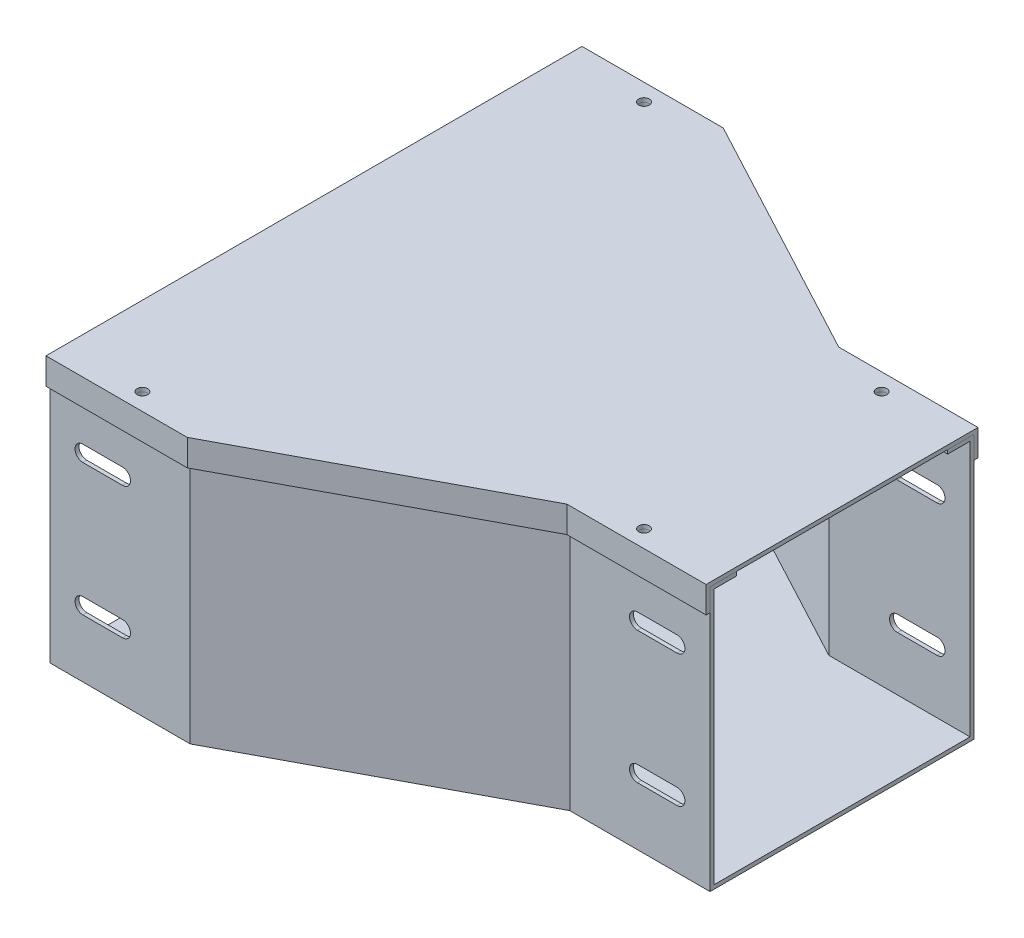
ISO-10303-21;
HEADER;
FILE_DESCRIPTION(('STEP AP214'),'2;1');
FILE_NAME('part.step','',(''),(''),'','','');
FILE_SCHEMA(('AUTOMOTIVE_DESIGN { 1 0 10303 214 1 1 1 1 }'));
ENDSEC;
DATA;
#1=APPLICATION_CONTEXT('core data for automotive mechanical design processes');
#2=APPLICATION_PROTOCOL_DEFINITION('international standard','automotive_design',2000,#1);
#3=PRODUCT_CONTEXT('',#1,'mechanical');
#4=PRODUCT('Part','Part','',(#3));
#5=PRODUCT_RELATED_PRODUCT_CATEGORY('part','',(#4));
#6=PRODUCT_DEFINITION_FORMATION('','',#4);
#7=PRODUCT_DEFINITION_CONTEXT('part definition',#1,'design');
#8=PRODUCT_DEFINITION('design','',#6,#7);
#9=PRODUCT_DEFINITION_SHAPE('','',#8);
#10=(LENGTH_UNIT() NAMED_UNIT(*) SI_UNIT(.MILLI.,.METRE.));
#11=(NAMED_UNIT(*) PLANE_ANGLE_UNIT() SI_UNIT($,.RADIAN.));
#12=(NAMED_UNIT(*) SI_UNIT($,.STERADIAN.) SOLID_ANGLE_UNIT());
#13=UNCERTAINTY_MEASURE_WITH_UNIT(LENGTH_MEASURE(1.E-05),#10,'distance_accuracy_value','');
#14=(GEOMETRIC_REPRESENTATION_CONTEXT(3) GLOBAL_UNCERTAINTY_ASSIGNED_CONTEXT((#13)) GLOBAL_UNIT_ASSIGNED_CONTEXT((#10,
#11,#12)) REPRESENTATION_CONTEXT('',''));
#15=CARTESIAN_POINT('',(0.,0.,0.));
#16=DIRECTION('',(0.,0.,1.));
#17=DIRECTION('',(1.,0.,0.));
#18=AXIS2_PLACEMENT_3D('',#15,#16,#17);
#19=CARTESIAN_POINT('',(-100.,51.5,-100.));
#20=DIRECTION('',(1.,0.,0.));
#21=DIRECTION('',(0.,0.,-1.));
#22=AXIS2_PLACEMENT_3D('',#19,#20,#21);
#23=PLANE('',#22);
#24=DIRECTION('',(0.,0.,1.));
#25=VECTOR('',#24,1.);
#26=CARTESIAN_POINT('',(-100.,50.,-100.));
#27=LINE('',#26,#25);
#28=CARTESIAN_POINT('',(-100.,50.,-100.));
#29=VERTEX_POINT('',#28);
#30=CARTESIAN_POINT('',(-100.,50.,100.));
#31=VERTEX_POINT('',#30);
#32=EDGE_CURVE('E271',#29,#31,#27,.T.);
#33=ORIENTED_EDGE('',*,*,#32,.T.);
#34=DIRECTION('',(0.,1.,0.));
#35=VECTOR('',#34,1.);
#36=CARTESIAN_POINT('',(-100.,41.5,100.));
#37=LINE('',#36,#35);
#38=CARTESIAN_POINT('',(-100.,41.5,100.));
#39=VERTEX_POINT('',#38);
#40=EDGE_CURVE('E209',#39,#31,#37,.T.);
#41=ORIENTED_EDGE('',*,*,#40,.F.);
#42=DIRECTION('',(0.,0.,-1.));
#43=VECTOR('',#42,1.);
#44=CARTESIAN_POINT('',(-100.,41.5,101.5));
#45=LINE('',#44,#43);
#46=CARTESIAN_POINT('',(-100.,41.5,101.5));
#47=VERTEX_POINT('',#46);
#48=EDGE_CURVE('E192',#47,#39,#45,.T.);
#49=ORIENTED_EDGE('',*,*,#48,.F.);
#50=DIRECTION('',(0.,1.,0.));
#51=VECTOR('',#50,1.);
#52=CARTESIAN_POINT('',(-100.,41.5,101.5));
#53=LINE('',#52,#51);
#54=CARTESIAN_POINT('',(-100.,51.5,101.5));
#55=VERTEX_POINT('',#54);
#56=EDGE_CURVE('E206',#47,#55,#53,.T.);
#57=ORIENTED_EDGE('',*,*,#56,.T.);
#58=DIRECTION('',(0.,0.,1.));
#59=VECTOR('',#58,1.);
#60=CARTESIAN_POINT('',(-100.,51.5,-100.));
#61=LINE('',#60,#59);
#62=CARTESIAN_POINT('',(-100.,51.5,-101.5));
#63=VERTEX_POINT('',#62);
#64=EDGE_CURVE('E50',#63,#55,#61,.T.);
#65=ORIENTED_EDGE('',*,*,#64,.F.);
#66=DIRECTION('',(0.,1.,0.));
#67=VECTOR('',#66,1.);
#68=CARTESIAN_POINT('',(-100.,41.5,-101.5));
#69=LINE('',#68,#67);
#70=CARTESIAN_POINT('',(-100.,41.5,-101.5));
#71=VERTEX_POINT('',#70);
#72=EDGE_CURVE('E239',#71,#63,#69,.T.);
#73=ORIENTED_EDGE('',*,*,#72,.F.);
#74=DIRECTION('',(0.,0.,-1.));
#75=VECTOR('',#74,1.);
#76=CARTESIAN_POINT('',(-100.,41.5,-100.));
#77=LINE('',#76,#75);
#78=CARTESIAN_POINT('',(-100.,41.5,-100.));
#79=VERTEX_POINT('',#78);
#80=EDGE_CURVE('E222',#79,#71,#77,.T.);
#81=ORIENTED_EDGE('',*,*,#80,.F.);
#82=DIRECTION('',(0.,1.,0.));
#83=VECTOR('',#82,1.);
#84=CARTESIAN_POINT('',(-100.,41.5,-100.));
#85=LINE('',#84,#83);
#86=EDGE_CURVE('E263',#79,#29,#85,.T.);
#87=ORIENTED_EDGE('',*,*,#86,.T.);
#88=EDGE_LOOP('',(#33,#41,#49,#57,#65,#73,#81,#87));
#89=FACE_BOUND('',#88,.T.);
#90=ADVANCED_FACE('F42',(#89),#23,.F.);
#91=CARTESIAN_POINT('',(100.,51.5,50.));
#92=DIRECTION('',(-1.,0.,0.));
#93=DIRECTION('',(0.,0.,1.));
#94=AXIS2_PLACEMENT_3D('',#91,#92,#93);
#95=PLANE('',#94);
#96=DIRECTION('',(0.,0.,-1.));
#97=VECTOR('',#96,1.);
#98=CARTESIAN_POINT('',(100.,50.,50.));
#99=LINE('',#98,#97);
#100=CARTESIAN_POINT('',(100.,50.,50.));
#101=VERTEX_POINT('',#100);
#102=CARTESIAN_POINT('',(100.,50.,-50.));
#103=VERTEX_POINT('',#102);
#104=EDGE_CURVE('E65',#101,#103,#99,.T.);
#105=ORIENTED_EDGE('',*,*,#104,.T.);
#106=DIRECTION('',(0.,1.,0.));
#107=VECTOR('',#106,1.);
#108=CARTESIAN_POINT('',(100.,41.5,-50.));
#109=LINE('',#108,#107);
#110=CARTESIAN_POINT('',(100.,41.5,-50.));
#111=VERTEX_POINT('',#110);
#112=EDGE_CURVE('E254',#111,#103,#109,.T.);
#113=ORIENTED_EDGE('',*,*,#112,.F.);
#114=DIRECTION('',(0.,0.,1.));
#115=VECTOR('',#114,1.);
#116=CARTESIAN_POINT('',(100.,41.5,-51.5));
#117=LINE('',#116,#115);
#118=CARTESIAN_POINT('',(100.,41.5,-51.5));
#119=VERTEX_POINT('',#118);
#120=EDGE_CURVE('E231',#119,#111,#117,.T.);
#121=ORIENTED_EDGE('',*,*,#120,.F.);
#122=DIRECTION('',(0.,1.,0.));
#123=VECTOR('',#122,1.);
#124=CARTESIAN_POINT('',(100.,41.5,-51.5));
#125=LINE('',#124,#123);
#126=CARTESIAN_POINT('',(100.,51.5,-51.5));
#127=VERTEX_POINT('',#126);
#128=EDGE_CURVE('E252',#119,#127,#125,.T.);
#129=ORIENTED_EDGE('',*,*,#128,.T.);
#130=DIRECTION('',(0.,0.,-1.));
#131=VECTOR('',#130,1.);
#132=CARTESIAN_POINT('',(100.,51.5,50.));
#133=LINE('',#132,#131);
#134=CARTESIAN_POINT('',(100.,51.5,51.5));
#135=VERTEX_POINT('',#134);
#136=EDGE_CURVE('E12',#135,#127,#133,.T.);
#137=ORIENTED_EDGE('',*,*,#136,.F.);
#138=DIRECTION('',(0.,1.,0.));
#139=VECTOR('',#138,1.);
#140=CARTESIAN_POINT('',(100.,41.5,51.5));
#141=LINE('',#140,#139);
#142=CARTESIAN_POINT('',(100.,41.5,51.5));
#143=VERTEX_POINT('',#142);
#144=EDGE_CURVE('E167',#143,#135,#141,.T.);
#145=ORIENTED_EDGE('',*,*,#144,.F.);
#146=DIRECTION('',(0.,0.,1.));
#147=VECTOR('',#146,1.);
#148=CARTESIAN_POINT('',(100.,41.5,50.));
#149=LINE('',#148,#147);
#150=CARTESIAN_POINT('',(100.,41.5,50.));
#151=VERTEX_POINT('',#150);
#152=EDGE_CURVE('E155',#151,#143,#149,.T.);
#153=ORIENTED_EDGE('',*,*,#152,.F.);
#154=DIRECTION('',(0.,1.,0.));
#155=VECTOR('',#154,1.);
#156=CARTESIAN_POINT('',(100.,41.5,50.));
#157=LINE('',#156,#155);
#158=EDGE_CURVE('E173',#151,#101,#157,.T.);
#159=ORIENTED_EDGE('',*,*,#158,.T.);
#160=EDGE_LOOP('',(#105,#113,#121,#129,#137,#145,#153,#159));
#161=FACE_BOUND('',#160,.T.);
#162=ADVANCED_FACE('F168',(#161),#95,.F.);
#163=CARTESIAN_POINT('',(0.,51.5,0.));
#164=DIRECTION('',(0.,1.,0.));
#165=DIRECTION('',(0.,0.,1.));
#166=AXIS2_PLACEMENT_3D('',#163,#164,#165);
#167=PLANE('',#166);
#168=CARTESIAN_POINT('',(-70.,51.5,-95.));
#169=DIRECTION('',(0.,1.,0.));
#170=DIRECTION('',(0.,0.,1.));
#171=AXIS2_PLACEMENT_3D('',#168,#169,#170);
#172=CIRCLE('',#171,2.);
#173=CARTESIAN_POINT('',(-70.,51.5,-93.));
#174=VERTEX_POINT('',#173);
#175=EDGE_CURVE('E362',#174,#174,#172,.T.);
#176=ORIENTED_EDGE('',*,*,#175,.F.);
#177=EDGE_LOOP('',(#176));
#178=FACE_BOUND('',#177,.T.);
#179=CARTESIAN_POINT('',(-70.,51.5,95.));
#180=DIRECTION('',(0.,1.,0.));
#181=DIRECTION('',(0.,0.,1.));
#182=AXIS2_PLACEMENT_3D('',#179,#180,#181);
#183=CIRCLE('',#182,2.);
#184=CARTESIAN_POINT('',(-70.,51.5,97.));
#185=VERTEX_POINT('',#184);
#186=EDGE_CURVE('E366',#185,#185,#183,.T.);
#187=ORIENTED_EDGE('',*,*,#186,.F.);
#188=EDGE_LOOP('',(#187));
#189=FACE_BOUND('',#188,.T.);
#190=CARTESIAN_POINT('',(70.,51.5,-45.));
#191=DIRECTION('',(0.,1.,0.));
#192=DIRECTION('',(0.,0.,1.));
#193=AXIS2_PLACEMENT_3D('',#190,#191,#192);
#194=CIRCLE('',#193,2.);
#195=CARTESIAN_POINT('',(70.,51.5,-43.));
#196=VERTEX_POINT('',#195);
#197=EDGE_CURVE('E370',#196,#196,#194,.T.);
#198=ORIENTED_EDGE('',*,*,#197,.F.);
#199=EDGE_LOOP('',(#198));
#200=FACE_BOUND('',#199,.T.);
#201=CARTESIAN_POINT('',(70.,51.5,45.));
#202=DIRECTION('',(0.,1.,0.));
#203=DIRECTION('',(0.,0.,1.));
#204=AXIS2_PLACEMENT_3D('',#201,#202,#203);
#205=CIRCLE('',#204,2.);
#206=CARTESIAN_POINT('',(70.,51.5,47.));
#207=VERTEX_POINT('',#206);
#208=EDGE_CURVE('E373',#207,#207,#205,.T.);
#209=ORIENTED_EDGE('',*,*,#208,.F.);
#210=EDGE_LOOP('',(#209));
#211=FACE_BOUND('',#210,.T.);
#212=ORIENTED_EDGE('',*,*,#136,.T.);
#213=DIRECTION('',(-1.,0.,0.));
#214=VECTOR('',#213,1.);
#215=CARTESIAN_POINT('',(100.,51.5,-51.5));
#216=LINE('',#215,#214);
#217=CARTESIAN_POINT('',(47.25,51.5,-51.5));
#218=VERTEX_POINT('',#217);
#219=EDGE_CURVE('E242',#127,#218,#216,.T.);
#220=ORIENTED_EDGE('',*,*,#219,.T.);
#221=DIRECTION('',(-0.882352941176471,0.,-0.470588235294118));
#222=VECTOR('',#221,1.);
#223=CARTESIAN_POINT('',(47.5808823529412,51.5,-51.3235294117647));
#224=LINE('',#223,#222);
#225=CARTESIAN_POINT('',(-46.5,51.5,-101.5));
#226=VERTEX_POINT('',#225);
#227=EDGE_CURVE('E223',#218,#226,#224,.T.);
#228=ORIENTED_EDGE('',*,*,#227,.T.);
#229=DIRECTION('',(1.,0.,0.));
#230=VECTOR('',#229,1.);
#231=CARTESIAN_POINT('',(-46.875,51.5,-101.5));
#232=LINE('',#231,#230);
#233=EDGE_CURVE('E203',#226,#63,#232,.F.);
#234=ORIENTED_EDGE('',*,*,#233,.T.);
#235=ORIENTED_EDGE('',*,*,#64,.T.);
#236=DIRECTION('',(1.,0.,0.));
#237=VECTOR('',#236,1.);
#238=CARTESIAN_POINT('',(-100.,51.5,101.5));
#239=LINE('',#238,#237);
#240=CARTESIAN_POINT('',(-46.5,51.5,101.5));
#241=VERTEX_POINT('',#240);
#242=EDGE_CURVE('E181',#55,#241,#239,.T.);
#243=ORIENTED_EDGE('',*,*,#242,.T.);
#244=DIRECTION('',(0.882352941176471,0.,-0.470588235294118));
#245=VECTOR('',#244,1.);
#246=CARTESIAN_POINT('',(-46.1691176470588,51.5,101.323529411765));
#247=LINE('',#246,#245);
#248=CARTESIAN_POINT('',(47.25,51.5,51.5));
#249=VERTEX_POINT('',#248);
#250=EDGE_CURVE('E178',#241,#249,#247,.T.);
#251=ORIENTED_EDGE('',*,*,#250,.T.);
#252=DIRECTION('',(1.,0.,0.));
#253=VECTOR('',#252,1.);
#254=CARTESIAN_POINT('',(46.875,51.5,51.5));
#255=LINE('',#254,#253);
#256=EDGE_CURVE('E198',#249,#135,#255,.T.);
#257=ORIENTED_EDGE('',*,*,#256,.T.);
#258=EDGE_LOOP('',(#212,#220,#228,#234,#235,#243,#251,#257));
#259=FACE_BOUND('',#258,.T.);
#260=ADVANCED_FACE('F310',(#178,#189,#200,#211,#259),#167,.T.);
#261=CARTESIAN_POINT('',(0.,50.,0.));
#262=DIRECTION('',(0.,1.,0.));
#263=DIRECTION('',(0.,0.,1.));
#264=AXIS2_PLACEMENT_3D('',#261,#262,#263);
#265=PLANE('',#264);
#266=CARTESIAN_POINT('',(-70.,50.,-95.));
#267=DIRECTION('',(0.,1.,0.));
#268=DIRECTION('',(0.,0.,1.));
#269=AXIS2_PLACEMENT_3D('',#266,#267,#268);
#270=CIRCLE('',#269,2.);
#271=CARTESIAN_POINT('',(-70.,50.,-93.));
#272=VERTEX_POINT('',#271);
#273=EDGE_CURVE('E385',#272,#272,#270,.F.);
#274=ORIENTED_EDGE('',*,*,#273,.F.);
#275=EDGE_LOOP('',(#274));
#276=FACE_BOUND('',#275,.T.);
#277=CARTESIAN_POINT('',(-70.,50.,95.));
#278=DIRECTION('',(0.,1.,0.));
#279=DIRECTION('',(0.,0.,1.));
#280=AXIS2_PLACEMENT_3D('',#277,#278,#279);
#281=CIRCLE('',#280,2.);
#282=CARTESIAN_POINT('',(-70.,50.,97.));
#283=VERTEX_POINT('',#282);
#284=EDGE_CURVE('E381',#283,#283,#281,.F.);
#285=ORIENTED_EDGE('',*,*,#284,.F.);
#286=EDGE_LOOP('',(#285));
#287=FACE_BOUND('',#286,.T.);
#288=CARTESIAN_POINT('',(70.,50.,-45.));
#289=DIRECTION('',(0.,1.,0.));
#290=DIRECTION('',(0.,0.,1.));
#291=AXIS2_PLACEMENT_3D('',#288,#289,#290);
#292=CIRCLE('',#291,2.);
#293=CARTESIAN_POINT('',(70.,50.,-43.));
#294=VERTEX_POINT('',#293);
#295=EDGE_CURVE('E375',#294,#294,#292,.F.);
#296=ORIENTED_EDGE('',*,*,#295,.F.);
#297=EDGE_LOOP('',(#296));
#298=FACE_BOUND('',#297,.T.);
#299=CARTESIAN_POINT('',(70.,50.,45.));
#300=DIRECTION('',(0.,1.,0.));
#301=DIRECTION('',(0.,0.,1.));
#302=AXIS2_PLACEMENT_3D('',#299,#300,#301);
#303=CIRCLE('',#302,2.);
#304=CARTESIAN_POINT('',(70.,50.,47.));
#305=VERTEX_POINT('',#304);
#306=EDGE_CURVE('E184',#305,#305,#303,.F.);
#307=ORIENTED_EDGE('',*,*,#306,.F.);
#308=EDGE_LOOP('',(#307));
#309=FACE_BOUND('',#308,.T.);
#310=DIRECTION('',(-1.,0.,0.));
#311=VECTOR('',#310,1.);
#312=CARTESIAN_POINT('',(-46.875,50.,-100.));
#313=LINE('',#312,#311);
#314=CARTESIAN_POINT('',(-46.875,50.,-100.));
#315=VERTEX_POINT('',#314);
#316=EDGE_CURVE('E249',#315,#29,#313,.T.);
#317=ORIENTED_EDGE('',*,*,#316,.F.);
#318=DIRECTION('',(-0.882352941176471,0.,-0.470588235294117));
#319=VECTOR('',#318,1.);
#320=CARTESIAN_POINT('',(46.875,50.,-50.));
#321=LINE('',#320,#319);
#322=CARTESIAN_POINT('',(46.875,50.,-50.));
#323=VERTEX_POINT('',#322);
#324=EDGE_CURVE('E45',#323,#315,#321,.T.);
#325=ORIENTED_EDGE('',*,*,#324,.F.);
#326=DIRECTION('',(-1.,0.,0.));
#327=VECTOR('',#326,1.);
#328=CARTESIAN_POINT('',(100.,50.,-50.));
#329=LINE('',#328,#327);
#330=EDGE_CURVE('E282',#103,#323,#329,.T.);
#331=ORIENTED_EDGE('',*,*,#330,.F.);
#332=ORIENTED_EDGE('',*,*,#104,.F.);
#333=DIRECTION('',(1.,0.,0.));
#334=VECTOR('',#333,1.);
#335=CARTESIAN_POINT('',(46.875,50.,50.));
#336=LINE('',#335,#334);
#337=CARTESIAN_POINT('',(46.875,50.,50.));
#338=VERTEX_POINT('',#337);
#339=EDGE_CURVE('E279',#338,#101,#336,.T.);
#340=ORIENTED_EDGE('',*,*,#339,.F.);
#341=DIRECTION('',(0.882352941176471,0.,-0.470588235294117));
#342=VECTOR('',#341,1.);
#343=CARTESIAN_POINT('',(0.,50.,75.));
#344=LINE('',#343,#342);
#345=CARTESIAN_POINT('',(-46.875,50.,100.));
#346=VERTEX_POINT('',#345);
#347=EDGE_CURVE('E276',#346,#338,#344,.T.);
#348=ORIENTED_EDGE('',*,*,#347,.F.);
#349=DIRECTION('',(1.,0.,0.));
#350=VECTOR('',#349,1.);
#351=CARTESIAN_POINT('',(-100.,50.,100.));
#352=LINE('',#351,#350);
#353=EDGE_CURVE('E273',#31,#346,#352,.T.);
#354=ORIENTED_EDGE('',*,*,#353,.F.);
#355=ORIENTED_EDGE('',*,*,#32,.F.);
#356=EDGE_LOOP('',(#317,#325,#331,#332,#340,#348,#354,#355));
#357=FACE_BOUND('',#356,.T.);
#358=ADVANCED_FACE('F303',(#276,#287,#298,#309,#357),#265,.F.);
#359=CARTESIAN_POINT('',(100.,41.5,-50.));
#360=DIRECTION('',(0.,0.,-1.));
#361=DIRECTION('',(-1.,0.,0.));
#362=AXIS2_PLACEMENT_3D('',#359,#360,#361);
#363=PLANE('',#362);
#364=ORIENTED_EDGE('',*,*,#112,.T.);
#365=ORIENTED_EDGE('',*,*,#330,.T.);
#366=DIRECTION('',(0.,1.,0.));
#367=VECTOR('',#366,1.);
#368=CARTESIAN_POINT('',(46.875,41.5,-50.));
#369=LINE('',#368,#367);
#370=CARTESIAN_POINT('',(46.875,41.5,-50.));
#371=VERTEX_POINT('',#370);
#372=EDGE_CURVE('E257',#371,#323,#369,.T.);
#373=ORIENTED_EDGE('',*,*,#372,.F.);
#374=DIRECTION('',(-1.,0.,0.));
#375=VECTOR('',#374,1.);
#376=CARTESIAN_POINT('',(100.,41.5,-50.));
#377=LINE('',#376,#375);
#378=EDGE_CURVE('E229',#111,#371,#377,.T.);
#379=ORIENTED_EDGE('',*,*,#378,.F.);
#380=EDGE_LOOP('',(#364,#365,#373,#379));
#381=FACE_BOUND('',#380,.T.);
#382=ADVANCED_FACE('F301',(#381),#363,.F.);
#383=CARTESIAN_POINT('',(46.875,41.5,-50.));
#384=DIRECTION('',(0.470588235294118,0.,-0.882352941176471));
#385=DIRECTION('',(-0.882352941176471,0.,-0.470588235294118));
#386=AXIS2_PLACEMENT_3D('',#383,#384,#385);
#387=PLANE('',#386);
#388=ORIENTED_EDGE('',*,*,#372,.T.);
#389=ORIENTED_EDGE('',*,*,#324,.T.);
#390=DIRECTION('',(0.,1.,0.));
#391=VECTOR('',#390,1.);
#392=CARTESIAN_POINT('',(-46.875,41.5,-100.));
#393=LINE('',#392,#391);
#394=CARTESIAN_POINT('',(-46.875,41.5,-100.));
#395=VERTEX_POINT('',#394);
#396=EDGE_CURVE('E260',#395,#315,#393,.T.);
#397=ORIENTED_EDGE('',*,*,#396,.F.);
#398=DIRECTION('',(-0.882352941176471,0.,-0.470588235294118));
#399=VECTOR('',#398,1.);
#400=CARTESIAN_POINT('',(46.875,41.5,-50.));
#401=LINE('',#400,#399);
#402=EDGE_CURVE('E227',#371,#395,#401,.T.);
#403=ORIENTED_EDGE('',*,*,#402,.F.);
#404=EDGE_LOOP('',(#388,#389,#397,#403));
#405=FACE_BOUND('',#404,.T.);
#406=ADVANCED_FACE('F287',(#405),#387,.F.);
#407=CARTESIAN_POINT('',(-46.875,41.5,-100.));
#408=DIRECTION('',(0.,0.,-1.));
#409=DIRECTION('',(-1.,0.,0.));
#410=AXIS2_PLACEMENT_3D('',#407,#408,#409);
#411=PLANE('',#410);
#412=ORIENTED_EDGE('',*,*,#396,.T.);
#413=ORIENTED_EDGE('',*,*,#316,.T.);
#414=ORIENTED_EDGE('',*,*,#86,.F.);
#415=DIRECTION('',(-1.,0.,0.));
#416=VECTOR('',#415,1.);
#417=CARTESIAN_POINT('',(-46.875,41.5,-100.));
#418=LINE('',#417,#416);
#419=EDGE_CURVE('E225',#395,#79,#418,.T.);
#420=ORIENTED_EDGE('',*,*,#419,.F.);
#421=EDGE_LOOP('',(#412,#413,#414,#420));
#422=FACE_BOUND('',#421,.T.);
#423=ADVANCED_FACE('F291',(#422),#411,.F.);
#424=CARTESIAN_POINT('',(-46.875,41.5,-101.5));
#425=DIRECTION('',(0.,0.,-1.));
#426=DIRECTION('',(-1.,0.,0.));
#427=AXIS2_PLACEMENT_3D('',#424,#425,#426);
#428=PLANE('',#427);
#429=ORIENTED_EDGE('',*,*,#233,.F.);
#430=DIRECTION('',(0.,1.,0.));
#431=VECTOR('',#430,1.);
#432=CARTESIAN_POINT('',(-46.5,41.5,-101.5));
#433=LINE('',#432,#431);
#434=CARTESIAN_POINT('',(-46.5,41.5,-101.5));
#435=VERTEX_POINT('',#434);
#436=EDGE_CURVE('E247',#435,#226,#433,.T.);
#437=ORIENTED_EDGE('',*,*,#436,.F.);
#438=DIRECTION('',(1.,0.,0.));
#439=VECTOR('',#438,1.);
#440=CARTESIAN_POINT('',(-46.875,41.5,-101.5));
#441=LINE('',#440,#439);
#442=EDGE_CURVE('E219',#435,#71,#441,.F.);
#443=ORIENTED_EDGE('',*,*,#442,.T.);
#444=ORIENTED_EDGE('',*,*,#72,.T.);
#445=EDGE_LOOP('',(#429,#437,#443,#444));
#446=FACE_BOUND('',#445,.T.);
#447=ADVANCED_FACE('F345',(#446),#428,.T.);
#448=CARTESIAN_POINT('',(47.5808823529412,41.5,-51.3235294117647));
#449=DIRECTION('',(0.470588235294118,0.,-0.882352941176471));
#450=DIRECTION('',(-0.882352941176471,0.,-0.470588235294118));
#451=AXIS2_PLACEMENT_3D('',#448,#449,#450);
#452=PLANE('',#451);
#453=ORIENTED_EDGE('',*,*,#227,.F.);
#454=DIRECTION('',(0.,1.,0.));
#455=VECTOR('',#454,1.);
#456=CARTESIAN_POINT('',(47.25,41.5,-51.5));
#457=LINE('',#456,#455);
#458=CARTESIAN_POINT('',(47.25,41.5,-51.5));
#459=VERTEX_POINT('',#458);
#460=EDGE_CURVE('E250',#459,#218,#457,.T.);
#461=ORIENTED_EDGE('',*,*,#460,.F.);
#462=DIRECTION('',(-0.882352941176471,0.,-0.470588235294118));
#463=VECTOR('',#462,1.);
#464=CARTESIAN_POINT('',(47.5808823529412,41.5,-51.3235294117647));
#465=LINE('',#464,#463);
#466=EDGE_CURVE('E236',#459,#435,#465,.T.);
#467=ORIENTED_EDGE('',*,*,#466,.T.);
#468=ORIENTED_EDGE('',*,*,#436,.T.);
#469=EDGE_LOOP('',(#453,#461,#467,#468));
#470=FACE_BOUND('',#469,.T.);
#471=ADVANCED_FACE('F342',(#470),#452,.T.);
#472=CARTESIAN_POINT('',(100.,41.5,-51.5));
#473=DIRECTION('',(0.,0.,-1.));
#474=DIRECTION('',(-1.,0.,0.));
#475=AXIS2_PLACEMENT_3D('',#472,#473,#474);
#476=PLANE('',#475);
#477=ORIENTED_EDGE('',*,*,#219,.F.);
#478=ORIENTED_EDGE('',*,*,#128,.F.);
#479=DIRECTION('',(-1.,0.,0.));
#480=VECTOR('',#479,1.);
#481=CARTESIAN_POINT('',(100.,41.5,-51.5));
#482=LINE('',#481,#480);
#483=EDGE_CURVE('E233',#119,#459,#482,.T.);
#484=ORIENTED_EDGE('',*,*,#483,.T.);
#485=ORIENTED_EDGE('',*,*,#460,.T.);
#486=EDGE_LOOP('',(#477,#478,#484,#485));
#487=FACE_BOUND('',#486,.T.);
#488=ADVANCED_FACE('F339',(#487),#476,.T.);
#489=CARTESIAN_POINT('',(0.,41.5,0.));
#490=DIRECTION('',(0.,1.,0.));
#491=DIRECTION('',(1.,0.,0.));
#492=AXIS2_PLACEMENT_3D('',#489,#490,#491);
#493=PLANE('',#492);
#494=ORIENTED_EDGE('',*,*,#442,.F.);
#495=ORIENTED_EDGE('',*,*,#466,.F.);
#496=ORIENTED_EDGE('',*,*,#483,.F.);
#497=ORIENTED_EDGE('',*,*,#120,.T.);
#498=ORIENTED_EDGE('',*,*,#378,.T.);
#499=ORIENTED_EDGE('',*,*,#402,.T.);
#500=ORIENTED_EDGE('',*,*,#419,.T.);
#501=ORIENTED_EDGE('',*,*,#80,.T.);
#502=EDGE_LOOP('',(#494,#495,#496,#497,#498,#499,#500,#501));
#503=FACE_BOUND('',#502,.T.);
#504=ADVANCED_FACE('F296',(#503),#493,.F.);
#505=CARTESIAN_POINT('',(-100.,41.5,100.));
#506=DIRECTION('',(0.,0.,1.));
#507=DIRECTION('',(1.,0.,0.));
#508=AXIS2_PLACEMENT_3D('',#505,#506,#507);
#509=PLANE('',#508);
#510=ORIENTED_EDGE('',*,*,#40,.T.);
#511=ORIENTED_EDGE('',*,*,#353,.T.);
#512=DIRECTION('',(0.,1.,0.));
#513=VECTOR('',#512,1.);
#514=CARTESIAN_POINT('',(-46.875,41.5,100.));
#515=LINE('',#514,#513);
#516=CARTESIAN_POINT('',(-46.875,41.5,100.));
#517=VERTEX_POINT('',#516);
#518=EDGE_CURVE('E212',#517,#346,#515,.T.);
#519=ORIENTED_EDGE('',*,*,#518,.F.);
#520=DIRECTION('',(1.,0.,0.));
#521=VECTOR('',#520,1.);
#522=CARTESIAN_POINT('',(-100.,41.5,100.));
#523=LINE('',#522,#521);
#524=EDGE_CURVE('E190',#39,#517,#523,.T.);
#525=ORIENTED_EDGE('',*,*,#524,.F.);
#526=EDGE_LOOP('',(#510,#511,#519,#525));
#527=FACE_BOUND('',#526,.T.);
#528=ADVANCED_FACE('F325',(#527),#509,.F.);
#529=CARTESIAN_POINT('',(-46.875,41.5,100.));
#530=DIRECTION('',(0.470588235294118,0.,0.882352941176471));
#531=DIRECTION('',(0.882352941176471,0.,-0.470588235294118));
#532=AXIS2_PLACEMENT_3D('',#529,#530,#531);
#533=PLANE('',#532);
#534=ORIENTED_EDGE('',*,*,#518,.T.);
#535=ORIENTED_EDGE('',*,*,#347,.T.);
#536=DIRECTION('',(0.,1.,0.));
#537=VECTOR('',#536,1.);
#538=CARTESIAN_POINT('',(46.875,41.5,50.));
#539=LINE('',#538,#537);
#540=CARTESIAN_POINT('',(46.875,41.5,50.));
#541=VERTEX_POINT('',#540);
#542=EDGE_CURVE('E215',#541,#338,#539,.T.);
#543=ORIENTED_EDGE('',*,*,#542,.F.);
#544=DIRECTION('',(0.882352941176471,0.,-0.470588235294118));
#545=VECTOR('',#544,1.);
#546=CARTESIAN_POINT('',(-46.875,41.5,100.));
#547=LINE('',#546,#545);
#548=EDGE_CURVE('E188',#517,#541,#547,.T.);
#549=ORIENTED_EDGE('',*,*,#548,.F.);
#550=EDGE_LOOP('',(#534,#535,#543,#549));
#551=FACE_BOUND('',#550,.T.);
#552=ADVANCED_FACE('F421',(#551),#533,.F.);
#553=CARTESIAN_POINT('',(46.875,41.5,50.));
#554=DIRECTION('',(0.,0.,1.));
#555=DIRECTION('',(1.,0.,0.));
#556=AXIS2_PLACEMENT_3D('',#553,#554,#555);
#557=PLANE('',#556);
#558=ORIENTED_EDGE('',*,*,#542,.T.);
#559=ORIENTED_EDGE('',*,*,#339,.T.);
#560=ORIENTED_EDGE('',*,*,#158,.F.);
#561=DIRECTION('',(1.,0.,0.));
#562=VECTOR('',#561,1.);
#563=CARTESIAN_POINT('',(46.875,41.5,50.));
#564=LINE('',#563,#562);
#565=EDGE_CURVE('E163',#541,#151,#564,.T.);
#566=ORIENTED_EDGE('',*,*,#565,.F.);
#567=EDGE_LOOP('',(#558,#559,#560,#566));
#568=FACE_BOUND('',#567,.T.);
#569=ADVANCED_FACE('F424',(#568),#557,.F.);
#570=CARTESIAN_POINT('',(46.875,41.5,51.5));
#571=DIRECTION('',(0.,0.,1.));
#572=DIRECTION('',(1.,0.,0.));
#573=AXIS2_PLACEMENT_3D('',#570,#571,#572);
#574=PLANE('',#573);
#575=ORIENTED_EDGE('',*,*,#256,.F.);
#576=DIRECTION('',(0.,1.,0.));
#577=VECTOR('',#576,1.);
#578=CARTESIAN_POINT('',(47.25,41.5,51.5));
#579=LINE('',#578,#577);
#580=CARTESIAN_POINT('',(47.25,41.5,51.5));
#581=VERTEX_POINT('',#580);
#582=EDGE_CURVE('E177',#581,#249,#579,.T.);
#583=ORIENTED_EDGE('',*,*,#582,.F.);
#584=DIRECTION('',(1.,0.,0.));
#585=VECTOR('',#584,1.);
#586=CARTESIAN_POINT('',(46.875,41.5,51.5));
#587=LINE('',#586,#585);
#588=EDGE_CURVE('E160',#581,#143,#587,.T.);
#589=ORIENTED_EDGE('',*,*,#588,.T.);
#590=ORIENTED_EDGE('',*,*,#144,.T.);
#591=EDGE_LOOP('',(#575,#583,#589,#590));
#592=FACE_BOUND('',#591,.T.);
#593=ADVANCED_FACE('F176',(#592),#574,.T.);
#594=CARTESIAN_POINT('',(-46.1691176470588,41.5,101.323529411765));
#595=DIRECTION('',(0.470588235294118,0.,0.882352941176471));
#596=DIRECTION('',(0.882352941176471,0.,-0.470588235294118));
#597=AXIS2_PLACEMENT_3D('',#594,#595,#596);
#598=PLANE('',#597);
#599=ORIENTED_EDGE('',*,*,#250,.F.);
#600=DIRECTION('',(0.,1.,0.));
#601=VECTOR('',#600,1.);
#602=CARTESIAN_POINT('',(-46.5,41.5,101.5));
#603=LINE('',#602,#601);
#604=CARTESIAN_POINT('',(-46.5,41.5,101.5));
#605=VERTEX_POINT('',#604);
#606=EDGE_CURVE('E204',#605,#241,#603,.T.);
#607=ORIENTED_EDGE('',*,*,#606,.F.);
#608=DIRECTION('',(0.882352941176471,0.,-0.470588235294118));
#609=VECTOR('',#608,1.);
#610=CARTESIAN_POINT('',(-46.1691176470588,41.5,101.323529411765));
#611=LINE('',#610,#609);
#612=EDGE_CURVE('E174',#605,#581,#611,.T.);
#613=ORIENTED_EDGE('',*,*,#612,.T.);
#614=ORIENTED_EDGE('',*,*,#582,.T.);
#615=EDGE_LOOP('',(#599,#607,#613,#614));
#616=FACE_BOUND('',#615,.T.);
#617=ADVANCED_FACE('F335',(#616),#598,.T.);
#618=CARTESIAN_POINT('',(-100.,41.5,101.5));
#619=DIRECTION('',(0.,0.,1.));
#620=DIRECTION('',(1.,0.,0.));
#621=AXIS2_PLACEMENT_3D('',#618,#619,#620);
#622=PLANE('',#621);
#623=ORIENTED_EDGE('',*,*,#242,.F.);
#624=ORIENTED_EDGE('',*,*,#56,.F.);
#625=DIRECTION('',(1.,0.,0.));
#626=VECTOR('',#625,1.);
#627=CARTESIAN_POINT('',(-100.,41.5,101.5));
#628=LINE('',#627,#626);
#629=EDGE_CURVE('E194',#47,#605,#628,.T.);
#630=ORIENTED_EDGE('',*,*,#629,.T.);
#631=ORIENTED_EDGE('',*,*,#606,.T.);
#632=EDGE_LOOP('',(#623,#624,#630,#631));
#633=FACE_BOUND('',#632,.T.);
#634=ADVANCED_FACE('F331',(#633),#622,.T.);
#635=CARTESIAN_POINT('',(0.,41.5,0.));
#636=DIRECTION('',(0.,-1.,0.));
#637=DIRECTION('',(-1.,0.,0.));
#638=AXIS2_PLACEMENT_3D('',#635,#636,#637);
#639=PLANE('',#638);
#640=ORIENTED_EDGE('',*,*,#588,.F.);
#641=ORIENTED_EDGE('',*,*,#612,.F.);
#642=ORIENTED_EDGE('',*,*,#629,.F.);
#643=ORIENTED_EDGE('',*,*,#48,.T.);
#644=ORIENTED_EDGE('',*,*,#524,.T.);
#645=ORIENTED_EDGE('',*,*,#548,.T.);
#646=ORIENTED_EDGE('',*,*,#565,.T.);
#647=ORIENTED_EDGE('',*,*,#152,.T.);
#648=EDGE_LOOP('',(#640,#641,#642,#643,#644,#645,#646,#647));
#649=FACE_BOUND('',#648,.T.);
#650=ADVANCED_FACE('F157',(#649),#639,.T.);
#651=CARTESIAN_POINT('',(70.,-50.001,45.));
#652=DIRECTION('',(0.,1.,0.));
#653=DIRECTION('',(0.,0.,1.));
#654=AXIS2_PLACEMENT_3D('',#651,#652,#653);
#655=CYLINDRICAL_SURFACE('',#654,2.);
#656=ORIENTED_EDGE('',*,*,#208,.T.);
#657=EDGE_LOOP('',(#656));
#658=FACE_BOUND('',#657,.T.);
#659=ORIENTED_EDGE('',*,*,#306,.T.);
#660=EDGE_LOOP('',(#659));
#661=FACE_BOUND('',#660,.T.);
#662=ADVANCED_FACE('F402',(#658,#661),#655,.F.);
#663=CARTESIAN_POINT('',(70.,-50.001,-45.));
#664=DIRECTION('',(0.,1.,0.));
#665=DIRECTION('',(0.,0.,1.));
#666=AXIS2_PLACEMENT_3D('',#663,#664,#665);
#667=CYLINDRICAL_SURFACE('',#666,2.);
#668=ORIENTED_EDGE('',*,*,#197,.T.);
#669=EDGE_LOOP('',(#668));
#670=FACE_BOUND('',#669,.T.);
#671=ORIENTED_EDGE('',*,*,#295,.T.);
#672=EDGE_LOOP('',(#671));
#673=FACE_BOUND('',#672,.T.);
#674=ADVANCED_FACE('F404',(#670,#673),#667,.F.);
#675=CARTESIAN_POINT('',(-70.,-50.001,95.));
#676=DIRECTION('',(0.,1.,0.));
#677=DIRECTION('',(0.,0.,1.));
#678=AXIS2_PLACEMENT_3D('',#675,#676,#677);
#679=CYLINDRICAL_SURFACE('',#678,2.);
#680=ORIENTED_EDGE('',*,*,#186,.T.);
#681=EDGE_LOOP('',(#680));
#682=FACE_BOUND('',#681,.T.);
#683=ORIENTED_EDGE('',*,*,#284,.T.);
#684=EDGE_LOOP('',(#683));
#685=FACE_BOUND('',#684,.T.);
#686=ADVANCED_FACE('F392',(#682,#685),#679,.F.);
#687=CARTESIAN_POINT('',(-70.,-50.001,-95.));
#688=DIRECTION('',(0.,1.,0.));
#689=DIRECTION('',(0.,0.,1.));
#690=AXIS2_PLACEMENT_3D('',#687,#688,#689);
#691=CYLINDRICAL_SURFACE('',#690,2.);
#692=ORIENTED_EDGE('',*,*,#175,.T.);
#693=EDGE_LOOP('',(#692));
#694=FACE_BOUND('',#693,.T.);
#695=ORIENTED_EDGE('',*,*,#273,.T.);
#696=EDGE_LOOP('',(#695));
#697=FACE_BOUND('',#696,.T.);
#698=ADVANCED_FACE('F389',(#694,#697),#691,.F.);
#699=CLOSED_SHELL('',(#90,#162,#260,#358,#382,#406,#423,#447,#471,#488,#504,#528,#552,#569,#593,
#617,#634,#650,#662,#674,#686,#698));
#700=MANIFOLD_SOLID_BREP('B2',#699);
#701=CARTESIAN_POINT('',(-100.,-48.5,-100.));
#702=DIRECTION('',(0.,0.,1.));
#703=DIRECTION('',(1.,0.,0.));
#704=AXIS2_PLACEMENT_3D('',#701,#702,#703);
#705=PLANE('',#704);
#706=DIRECTION('',(-1.,0.,0.));
#707=VECTOR('',#706,1.);
#708=CARTESIAN_POINT('',(-87.5,-22.,-100.));
#709=LINE('',#708,#707);
#710=CARTESIAN_POINT('',(-72.5,-22.,-100.));
#711=VERTEX_POINT('',#710);
#712=CARTESIAN_POINT('',(-87.5,-22.,-100.));
#713=VERTEX_POINT('',#712);
#714=EDGE_CURVE('E1034',#711,#713,#709,.T.);
#715=ORIENTED_EDGE('',*,*,#714,.T.);
#716=CARTESIAN_POINT('',(-87.5,-25.,-100.));
#717=DIRECTION('',(0.,0.,1.));
#718=DIRECTION('',(1.,0.,0.));
#719=AXIS2_PLACEMENT_3D('',#716,#717,#718);
#720=CIRCLE('',#719,3.);
#721=CARTESIAN_POINT('',(-87.5,-28.,-100.));
#722=VERTEX_POINT('',#721);
#723=EDGE_CURVE('E1025',#713,#722,#720,.T.);
#724=ORIENTED_EDGE('',*,*,#723,.T.);
#725=DIRECTION('',(1.,0.,0.));
#726=VECTOR('',#725,1.);
#727=CARTESIAN_POINT('',(-87.5,-28.,-100.));
#728=LINE('',#727,#726);
#729=CARTESIAN_POINT('',(-72.5,-28.,-100.));
#730=VERTEX_POINT('',#729);
#731=EDGE_CURVE('E1028',#722,#730,#728,.T.);
#732=ORIENTED_EDGE('',*,*,#731,.T.);
#733=CARTESIAN_POINT('',(-72.5,-25.,-100.));
#734=DIRECTION('',(0.,0.,1.));
#735=DIRECTION('',(1.,0.,0.));
#736=AXIS2_PLACEMENT_3D('',#733,#734,#735);
#737=CIRCLE('',#736,3.);
#738=EDGE_CURVE('E1031',#730,#711,#737,.T.);
#739=ORIENTED_EDGE('',*,*,#738,.T.);
#740=EDGE_LOOP('',(#715,#724,#732,#739));
#741=FACE_BOUND('',#740,.T.);
#742=DIRECTION('',(-1.,0.,0.));
#743=VECTOR('',#742,1.);
#744=CARTESIAN_POINT('',(-87.5,28.,-100.));
#745=LINE('',#744,#743);
#746=CARTESIAN_POINT('',(-72.5,28.,-100.));
#747=VERTEX_POINT('',#746);
#748=CARTESIAN_POINT('',(-87.5,28.,-100.));
#749=VERTEX_POINT('',#748);
#750=EDGE_CURVE('E1081',#747,#749,#745,.T.);
#751=ORIENTED_EDGE('',*,*,#750,.T.);
#752=CARTESIAN_POINT('',(-87.5,25.,-100.));
#753=DIRECTION('',(0.,0.,1.));
#754=DIRECTION('',(1.,0.,0.));
#755=AXIS2_PLACEMENT_3D('',#752,#753,#754);
#756=CIRCLE('',#755,3.);
#757=CARTESIAN_POINT('',(-87.5,22.,-100.));
#758=VERTEX_POINT('',#757);
#759=EDGE_CURVE('E1072',#749,#758,#756,.T.);
#760=ORIENTED_EDGE('',*,*,#759,.T.);
#761=DIRECTION('',(1.,0.,0.));
#762=VECTOR('',#761,1.);
#763=CARTESIAN_POINT('',(-87.5,22.,-100.));
#764=LINE('',#763,#762);
#765=CARTESIAN_POINT('',(-72.5,22.,-100.));
#766=VERTEX_POINT('',#765);
#767=EDGE_CURVE('E1075',#758,#766,#764,.T.);
#768=ORIENTED_EDGE('',*,*,#767,.T.);
#769=CARTESIAN_POINT('',(-72.5,25.,-100.));
#770=DIRECTION('',(0.,0.,1.));
#771=DIRECTION('',(1.,0.,0.));
#772=AXIS2_PLACEMENT_3D('',#769,#770,#771);
#773=CIRCLE('',#772,3.);
#774=EDGE_CURVE('E1078',#766,#747,#773,.T.);
#775=ORIENTED_EDGE('',*,*,#774,.T.);
#776=EDGE_LOOP('',(#751,#760,#768,#775));
#777=FACE_BOUND('',#776,.T.);
#778=DIRECTION('',(-1.,0.,0.));
#779=VECTOR('',#778,1.);
#780=CARTESIAN_POINT('',(-100.,-50.,-100.));
#781=LINE('',#780,#779);
#782=CARTESIAN_POINT('',(-46.875,-50.,-100.));
#783=VERTEX_POINT('',#782);
#784=CARTESIAN_POINT('',(-100.,-50.,-100.));
#785=VERTEX_POINT('',#784);
#786=EDGE_CURVE('E1265',#783,#785,#781,.T.);
#787=ORIENTED_EDGE('',*,*,#786,.T.);
#788=DIRECTION('',(0.,-1.,0.));
#789=VECTOR('',#788,1.);
#790=CARTESIAN_POINT('',(-100.,-48.5,-100.));
#791=LINE('',#790,#789);
#792=CARTESIAN_POINT('',(-100.,50.,-100.));
#793=VERTEX_POINT('',#792);
#794=EDGE_CURVE('E1309',#793,#785,#791,.T.);
#795=ORIENTED_EDGE('',*,*,#794,.F.);
#796=DIRECTION('',(-1.,0.,0.));
#797=VECTOR('',#796,1.);
#798=CARTESIAN_POINT('',(-46.875,50.,-100.));
#799=LINE('',#798,#797);
#800=CARTESIAN_POINT('',(-46.875,50.,-100.));
#801=VERTEX_POINT('',#800);
#802=EDGE_CURVE('E1206',#801,#793,#799,.T.);
#803=ORIENTED_EDGE('',*,*,#802,.F.);
#804=DIRECTION('',(0.,-1.,0.));
#805=VECTOR('',#804,1.);
#806=CARTESIAN_POINT('',(-46.875,-48.5,-100.));
#807=LINE('',#806,#805);
#808=EDGE_CURVE('E1273',#801,#783,#807,.T.);
#809=ORIENTED_EDGE('',*,*,#808,.T.);
#810=EDGE_LOOP('',(#787,#795,#803,#809));
#811=FACE_BOUND('',#810,.T.);
#812=ADVANCED_FACE('F576',(#741,#777,#811),#705,.F.);
#813=CARTESIAN_POINT('',(-100.,-48.5,-100.));
#814=DIRECTION('',(1.,0.,0.));
#815=DIRECTION('',(0.,0.,-1.));
#816=AXIS2_PLACEMENT_3D('',#813,#814,#815);
#817=PLANE('',#816);
#818=DIRECTION('',(0.,-1.,0.));
#819=VECTOR('',#818,1.);
#820=CARTESIAN_POINT('',(-100.,50.,-98.5));
#821=LINE('',#820,#819);
#822=CARTESIAN_POINT('',(-100.,48.5,-98.5));
#823=VERTEX_POINT('',#822);
#824=CARTESIAN_POINT('',(-100.,-48.5,-98.5));
#825=VERTEX_POINT('',#824);
#826=EDGE_CURVE('E953',#823,#825,#821,.T.);
#827=ORIENTED_EDGE('',*,*,#826,.F.);
#828=DIRECTION('',(0.,0.,-1.));
#829=VECTOR('',#828,1.);
#830=CARTESIAN_POINT('',(-100.,48.5,-90.));
#831=LINE('',#830,#829);
#832=CARTESIAN_POINT('',(-100.,48.5,-90.));
#833=VERTEX_POINT('',#832);
#834=EDGE_CURVE('E933',#833,#823,#831,.T.);
#835=ORIENTED_EDGE('',*,*,#834,.F.);
#836=DIRECTION('',(0.,1.,0.));
#837=VECTOR('',#836,1.);
#838=CARTESIAN_POINT('',(-100.,48.5,-90.));
#839=LINE('',#838,#837);
#840=CARTESIAN_POINT('',(-100.,50.,-90.));
#841=VERTEX_POINT('',#840);
#842=EDGE_CURVE('E942',#833,#841,#839,.T.);
#843=ORIENTED_EDGE('',*,*,#842,.T.);
#844=DIRECTION('',(0.,0.,1.));
#845=VECTOR('',#844,1.);
#846=CARTESIAN_POINT('',(-100.,50.,-100.));
#847=LINE('',#846,#845);
#848=EDGE_CURVE('E1204',#793,#841,#847,.T.);
#849=ORIENTED_EDGE('',*,*,#848,.F.);
#850=ORIENTED_EDGE('',*,*,#794,.T.);
#851=DIRECTION('',(0.,0.,1.));
#852=VECTOR('',#851,1.);
#853=CARTESIAN_POINT('',(-100.,-50.,-100.));
#854=LINE('',#853,#852);
#855=CARTESIAN_POINT('',(-100.,-50.,100.));
#856=VERTEX_POINT('',#855);
#857=EDGE_CURVE('E1276',#785,#856,#854,.T.);
#858=ORIENTED_EDGE('',*,*,#857,.T.);
#859=DIRECTION('',(0.,-1.,0.));
#860=VECTOR('',#859,1.);
#861=CARTESIAN_POINT('',(-100.,-48.5,100.));
#862=LINE('',#861,#860);
#863=CARTESIAN_POINT('',(-100.,50.,100.));
#864=VERTEX_POINT('',#863);
#865=EDGE_CURVE('E1307',#864,#856,#862,.T.);
#866=ORIENTED_EDGE('',*,*,#865,.F.);
#867=DIRECTION('',(0.,0.,1.));
#868=VECTOR('',#867,1.);
#869=CARTESIAN_POINT('',(-100.,50.,98.5));
#870=LINE('',#869,#868);
#871=CARTESIAN_POINT('',(-100.,50.,90.));
#872=VERTEX_POINT('',#871);
#873=EDGE_CURVE('E1245',#872,#864,#870,.T.);
#874=ORIENTED_EDGE('',*,*,#873,.F.);
#875=DIRECTION('',(0.,1.,0.));
#876=VECTOR('',#875,1.);
#877=CARTESIAN_POINT('',(-100.,48.5,90.));
#878=LINE('',#877,#876);
#879=CARTESIAN_POINT('',(-100.,48.5,90.));
#880=VERTEX_POINT('',#879);
#881=EDGE_CURVE('E997',#880,#872,#878,.T.);
#882=ORIENTED_EDGE('',*,*,#881,.F.);
#883=DIRECTION('',(0.,0.,-1.));
#884=VECTOR('',#883,1.);
#885=CARTESIAN_POINT('',(-100.,48.5,100.));
#886=LINE('',#885,#884);
#887=CARTESIAN_POINT('',(-100.,48.5,98.5));
#888=VERTEX_POINT('',#887);
#889=EDGE_CURVE('E989',#888,#880,#886,.T.);
#890=ORIENTED_EDGE('',*,*,#889,.F.);
#891=DIRECTION('',(0.,-1.,0.));
#892=VECTOR('',#891,1.);
#893=CARTESIAN_POINT('',(-100.,50.,98.5));
#894=LINE('',#893,#892);
#895=CARTESIAN_POINT('',(-100.,-48.5,98.5));
#896=VERTEX_POINT('',#895);
#897=EDGE_CURVE('E1254',#888,#896,#894,.T.);
#898=ORIENTED_EDGE('',*,*,#897,.T.);
#899=DIRECTION('',(0.,0.,1.));
#900=VECTOR('',#899,1.);
#901=CARTESIAN_POINT('',(-100.,-48.5,-100.));
#902=LINE('',#901,#900);
#903=EDGE_CURVE('E1266',#825,#896,#902,.T.);
#904=ORIENTED_EDGE('',*,*,#903,.F.);
#905=EDGE_LOOP('',(#827,#835,#843,#849,#850,#858,#866,#874,#882,#890,#898,#904));
#906=FACE_BOUND('',#905,.T.);
#907=ADVANCED_FACE('F951',(#906),#817,.F.);
#908=CARTESIAN_POINT('',(-100.,-48.5,100.));
#909=DIRECTION('',(0.,0.,-1.));
#910=DIRECTION('',(-1.,0.,0.));
#911=AXIS2_PLACEMENT_3D('',#908,#909,#910);
#912=PLANE('',#911);
#913=DIRECTION('',(1.,0.,0.));
#914=VECTOR('',#913,1.);
#915=CARTESIAN_POINT('',(-87.5,-28.,100.));
#916=LINE('',#915,#914);
#917=CARTESIAN_POINT('',(-87.5,-28.,100.));
#918=VERTEX_POINT('',#917);
#919=CARTESIAN_POINT('',(-72.5,-28.,100.));
#920=VERTEX_POINT('',#919);
#921=EDGE_CURVE('E1016',#918,#920,#916,.T.);
#922=ORIENTED_EDGE('',*,*,#921,.F.);
#923=CARTESIAN_POINT('',(-87.5,-25.,100.));
#924=DIRECTION('',(0.,0.,1.));
#925=DIRECTION('',(1.,0.,0.));
#926=AXIS2_PLACEMENT_3D('',#923,#924,#925);
#927=CIRCLE('',#926,3.);
#928=CARTESIAN_POINT('',(-87.5,-22.,100.));
#929=VERTEX_POINT('',#928);
#930=EDGE_CURVE('E1014',#929,#918,#927,.T.);
#931=ORIENTED_EDGE('',*,*,#930,.F.);
#932=DIRECTION('',(-1.,0.,0.));
#933=VECTOR('',#932,1.);
#934=CARTESIAN_POINT('',(-87.5,-22.,100.));
#935=LINE('',#934,#933);
#936=CARTESIAN_POINT('',(-72.5,-22.,100.));
#937=VERTEX_POINT('',#936);
#938=EDGE_CURVE('E1022',#937,#929,#935,.T.);
#939=ORIENTED_EDGE('',*,*,#938,.F.);
#940=CARTESIAN_POINT('',(-72.5,-25.,100.));
#941=DIRECTION('',(0.,0.,1.));
#942=DIRECTION('',(1.,0.,0.));
#943=AXIS2_PLACEMENT_3D('',#940,#941,#942);
#944=CIRCLE('',#943,3.);
#945=EDGE_CURVE('E1019',#920,#937,#944,.T.);
#946=ORIENTED_EDGE('',*,*,#945,.F.);
#947=EDGE_LOOP('',(#922,#931,#939,#946));
#948=FACE_BOUND('',#947,.T.);
#949=DIRECTION('',(1.,0.,0.));
#950=VECTOR('',#949,1.);
#951=CARTESIAN_POINT('',(-87.5,22.,100.));
#952=LINE('',#951,#950);
#953=CARTESIAN_POINT('',(-87.5,22.,100.));
#954=VERTEX_POINT('',#953);
#955=CARTESIAN_POINT('',(-72.5,22.,100.));
#956=VERTEX_POINT('',#955);
#957=EDGE_CURVE('E1063',#954,#956,#952,.T.);
#958=ORIENTED_EDGE('',*,*,#957,.F.);
#959=CARTESIAN_POINT('',(-87.5,25.,100.));
#960=DIRECTION('',(0.,0.,1.));
#961=DIRECTION('',(1.,0.,0.));
#962=AXIS2_PLACEMENT_3D('',#959,#960,#961);
#963=CIRCLE('',#962,3.);
#964=CARTESIAN_POINT('',(-87.5,28.,100.));
#965=VERTEX_POINT('',#964);
#966=EDGE_CURVE('E1061',#965,#954,#963,.T.);
#967=ORIENTED_EDGE('',*,*,#966,.F.);
#968=DIRECTION('',(-1.,0.,0.));
#969=VECTOR('',#968,1.);
#970=CARTESIAN_POINT('',(-87.5,28.,100.));
#971=LINE('',#970,#969);
#972=CARTESIAN_POINT('',(-72.5,28.,100.));
#973=VERTEX_POINT('',#972);
#974=EDGE_CURVE('E1069',#973,#965,#971,.T.);
#975=ORIENTED_EDGE('',*,*,#974,.F.);
#976=CARTESIAN_POINT('',(-72.5,25.,100.));
#977=DIRECTION('',(0.,0.,1.));
#978=DIRECTION('',(1.,0.,0.));
#979=AXIS2_PLACEMENT_3D('',#976,#977,#978);
#980=CIRCLE('',#979,3.);
#981=EDGE_CURVE('E1066',#956,#973,#980,.T.);
#982=ORIENTED_EDGE('',*,*,#981,.F.);
#983=EDGE_LOOP('',(#958,#967,#975,#982));
#984=FACE_BOUND('',#983,.T.);
#985=DIRECTION('',(1.,0.,0.));
#986=VECTOR('',#985,1.);
#987=CARTESIAN_POINT('',(-100.,-50.,100.));
#988=LINE('',#987,#986);
#989=CARTESIAN_POINT('',(-46.875,-50.,100.));
#990=VERTEX_POINT('',#989);
#991=EDGE_CURVE('E1279',#856,#990,#988,.T.);
#992=ORIENTED_EDGE('',*,*,#991,.T.);
#993=DIRECTION('',(0.,-1.,0.));
#994=VECTOR('',#993,1.);
#995=CARTESIAN_POINT('',(-46.875,-48.5,100.));
#996=LINE('',#995,#994);
#997=CARTESIAN_POINT('',(-46.875,50.,100.));
#998=VERTEX_POINT('',#997);
#999=EDGE_CURVE('E1305',#998,#990,#996,.T.);
#1000=ORIENTED_EDGE('',*,*,#999,.F.);
#1001=DIRECTION('',(1.,0.,0.));
#1002=VECTOR('',#1001,1.);
#1003=CARTESIAN_POINT('',(-100.,50.,100.));
#1004=LINE('',#1003,#1002);
#1005=EDGE_CURVE('E1242',#864,#998,#1004,.T.);
#1006=ORIENTED_EDGE('',*,*,#1005,.F.);
#1007=ORIENTED_EDGE('',*,*,#865,.T.);
#1008=EDGE_LOOP('',(#992,#1000,#1006,#1007));
#1009=FACE_BOUND('',#1008,.T.);
#1010=ADVANCED_FACE('F1411',(#948,#984,#1009),#912,.F.);
#1011=CARTESIAN_POINT('',(0.,-48.5,75.));
#1012=DIRECTION('',(-0.470588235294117,0.,-0.882352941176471));
#1013=DIRECTION('',(-0.882352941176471,0.,0.470588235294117));
#1014=AXIS2_PLACEMENT_3D('',#1011,#1012,#1013);
#1015=PLANE('',#1014);
#1016=DIRECTION('',(0.882352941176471,0.,-0.470588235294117));
#1017=VECTOR('',#1016,1.);
#1018=CARTESIAN_POINT('',(0.,-50.,75.));
#1019=LINE('',#1018,#1017);
#1020=CARTESIAN_POINT('',(46.875,-50.,50.));
#1021=VERTEX_POINT('',#1020);
#1022=EDGE_CURVE('E1282',#990,#1021,#1019,.T.);
#1023=ORIENTED_EDGE('',*,*,#1022,.T.);
#1024=DIRECTION('',(0.,-1.,0.));
#1025=VECTOR('',#1024,1.);
#1026=CARTESIAN_POINT('',(46.875,-48.5,50.));
#1027=LINE('',#1026,#1025);
#1028=CARTESIAN_POINT('',(46.875,50.,50.));
#1029=VERTEX_POINT('',#1028);
#1030=EDGE_CURVE('E1303',#1029,#1021,#1027,.T.);
#1031=ORIENTED_EDGE('',*,*,#1030,.F.);
#1032=DIRECTION('',(0.882352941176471,0.,-0.470588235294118));
#1033=VECTOR('',#1032,1.);
#1034=CARTESIAN_POINT('',(-46.875,50.,100.));
#1035=LINE('',#1034,#1033);
#1036=EDGE_CURVE('E1239',#998,#1029,#1035,.T.);
#1037=ORIENTED_EDGE('',*,*,#1036,.F.);
#1038=ORIENTED_EDGE('',*,*,#999,.T.);
#1039=EDGE_LOOP('',(#1023,#1031,#1037,#1038));
#1040=FACE_BOUND('',#1039,.T.);
#1041=ADVANCED_FACE('F1465',(#1040),#1015,.F.);
#1042=CARTESIAN_POINT('',(100.,-48.5,50.));
#1043=DIRECTION('',(0.,0.,-1.));
#1044=DIRECTION('',(-1.,0.,0.));
#1045=AXIS2_PLACEMENT_3D('',#1042,#1043,#1044);
#1046=PLANE('',#1045);
#1047=DIRECTION('',(-1.,0.,0.));
#1048=VECTOR('',#1047,1.);
#1049=CARTESIAN_POINT('',(100.,-28.,50.));
#1050=LINE('',#1049,#1048);
#1051=CARTESIAN_POINT('',(87.5,-28.,50.));
#1052=VERTEX_POINT('',#1051);
#1053=CARTESIAN_POINT('',(72.5,-28.,50.));
#1054=VERTEX_POINT('',#1053);
#1055=EDGE_CURVE('E1128',#1052,#1054,#1050,.T.);
#1056=ORIENTED_EDGE('',*,*,#1055,.T.);
#1057=CARTESIAN_POINT('',(72.5,-25.,50.));
#1058=DIRECTION('',(0.,0.,-1.));
#1059=DIRECTION('',(-1.,0.,0.));
#1060=AXIS2_PLACEMENT_3D('',#1057,#1058,#1059);
#1061=CIRCLE('',#1060,3.);
#1062=CARTESIAN_POINT('',(72.5,-22.,50.));
#1063=VERTEX_POINT('',#1062);
#1064=EDGE_CURVE('E1153',#1054,#1063,#1061,.T.);
#1065=ORIENTED_EDGE('',*,*,#1064,.T.);
#1066=DIRECTION('',(1.,0.,0.));
#1067=VECTOR('',#1066,1.);
#1068=CARTESIAN_POINT('',(100.,-22.,50.));
#1069=LINE('',#1068,#1067);
#1070=CARTESIAN_POINT('',(87.5,-22.,50.));
#1071=VERTEX_POINT('',#1070);
#1072=EDGE_CURVE('E1145',#1063,#1071,#1069,.T.);
#1073=ORIENTED_EDGE('',*,*,#1072,.T.);
#1074=CARTESIAN_POINT('',(87.5,-25.,50.));
#1075=DIRECTION('',(0.,0.,-1.));
#1076=DIRECTION('',(-1.,0.,0.));
#1077=AXIS2_PLACEMENT_3D('',#1074,#1075,#1076);
#1078=CIRCLE('',#1077,3.);
#1079=EDGE_CURVE('E1137',#1071,#1052,#1078,.T.);
#1080=ORIENTED_EDGE('',*,*,#1079,.T.);
#1081=EDGE_LOOP('',(#1056,#1065,#1073,#1080));
#1082=FACE_BOUND('',#1081,.T.);
#1083=DIRECTION('',(-1.,0.,0.));
#1084=VECTOR('',#1083,1.);
#1085=CARTESIAN_POINT('',(100.,22.,50.));
#1086=LINE('',#1085,#1084);
#1087=CARTESIAN_POINT('',(87.5,22.,50.));
#1088=VERTEX_POINT('',#1087);
#1089=CARTESIAN_POINT('',(72.5,22.,50.));
#1090=VERTEX_POINT('',#1089);
#1091=EDGE_CURVE('E1176',#1088,#1090,#1086,.T.);
#1092=ORIENTED_EDGE('',*,*,#1091,.T.);
#1093=CARTESIAN_POINT('',(72.5,25.,50.));
#1094=DIRECTION('',(0.,0.,-1.));
#1095=DIRECTION('',(-1.,0.,0.));
#1096=AXIS2_PLACEMENT_3D('',#1093,#1094,#1095);
#1097=CIRCLE('',#1096,3.);
#1098=CARTESIAN_POINT('',(72.5,28.,50.));
#1099=VERTEX_POINT('',#1098);
#1100=EDGE_CURVE('E1201',#1090,#1099,#1097,.T.);
#1101=ORIENTED_EDGE('',*,*,#1100,.T.);
#1102=DIRECTION('',(1.,0.,0.));
#1103=VECTOR('',#1102,1.);
#1104=CARTESIAN_POINT('',(100.,28.,50.));
#1105=LINE('',#1104,#1103);
#1106=CARTESIAN_POINT('',(87.5,28.,50.));
#1107=VERTEX_POINT('',#1106);
#1108=EDGE_CURVE('E1193',#1099,#1107,#1105,.T.);
#1109=ORIENTED_EDGE('',*,*,#1108,.T.);
#1110=CARTESIAN_POINT('',(87.5,25.,50.));
#1111=DIRECTION('',(0.,0.,-1.));
#1112=DIRECTION('',(-1.,0.,0.));
#1113=AXIS2_PLACEMENT_3D('',#1110,#1111,#1112);
#1114=CIRCLE('',#1113,3.);
#1115=EDGE_CURVE('E1185',#1107,#1088,#1114,.T.);
#1116=ORIENTED_EDGE('',*,*,#1115,.T.);
#1117=EDGE_LOOP('',(#1092,#1101,#1109,#1116));
#1118=FACE_BOUND('',#1117,.T.);
#1119=DIRECTION('',(1.,0.,0.));
#1120=VECTOR('',#1119,1.);
#1121=CARTESIAN_POINT('',(100.,-50.,50.));
#1122=LINE('',#1121,#1120);
#1123=CARTESIAN_POINT('',(100.,-50.,50.));
#1124=VERTEX_POINT('',#1123);
#1125=EDGE_CURVE('E1285',#1021,#1124,#1122,.T.);
#1126=ORIENTED_EDGE('',*,*,#1125,.T.);
#1127=DIRECTION('',(0.,-1.,0.));
#1128=VECTOR('',#1127,1.);
#1129=CARTESIAN_POINT('',(100.,-48.5,50.));
#1130=LINE('',#1129,#1128);
#1131=CARTESIAN_POINT('',(100.,50.,50.));
#1132=VERTEX_POINT('',#1131);
#1133=EDGE_CURVE('E1301',#1132,#1124,#1130,.T.);
#1134=ORIENTED_EDGE('',*,*,#1133,.F.);
#1135=DIRECTION('',(1.,0.,0.));
#1136=VECTOR('',#1135,1.);
#1137=CARTESIAN_POINT('',(46.875,50.,50.));
#1138=LINE('',#1137,#1136);
#1139=EDGE_CURVE('E1236',#1029,#1132,#1138,.T.);
#1140=ORIENTED_EDGE('',*,*,#1139,.F.);
#1141=ORIENTED_EDGE('',*,*,#1030,.T.);
#1142=EDGE_LOOP('',(#1126,#1134,#1140,#1141));
#1143=FACE_BOUND('',#1142,.T.);
#1144=ADVANCED_FACE('F1462',(#1082,#1118,#1143),#1046,.F.);
#1145=CARTESIAN_POINT('',(100.,-48.5,-50.));
#1146=DIRECTION('',(-1.,0.,0.));
#1147=DIRECTION('',(0.,0.,1.));
#1148=AXIS2_PLACEMENT_3D('',#1145,#1146,#1147);
#1149=PLANE('',#1148);
#1150=DIRECTION('',(0.,0.,-1.));
#1151=VECTOR('',#1150,1.);
#1152=CARTESIAN_POINT('',(100.,-50.,-50.));
#1153=LINE('',#1152,#1151);
#1154=CARTESIAN_POINT('',(100.,-50.,-50.));
#1155=VERTEX_POINT('',#1154);
#1156=EDGE_CURVE('E1288',#1124,#1155,#1153,.T.);
#1157=ORIENTED_EDGE('',*,*,#1156,.T.);
#1158=DIRECTION('',(0.,-1.,0.));
#1159=VECTOR('',#1158,1.);
#1160=CARTESIAN_POINT('',(100.,-48.5,-50.));
#1161=LINE('',#1160,#1159);
#1162=CARTESIAN_POINT('',(100.,50.,-50.));
#1163=VERTEX_POINT('',#1162);
#1164=EDGE_CURVE('E1299',#1163,#1155,#1161,.T.);
#1165=ORIENTED_EDGE('',*,*,#1164,.F.);
#1166=DIRECTION('',(0.,0.,-1.));
#1167=VECTOR('',#1166,1.);
#1168=CARTESIAN_POINT('',(100.,50.,-48.5));
#1169=LINE('',#1168,#1167);
#1170=CARTESIAN_POINT('',(100.,50.,-40.));
#1171=VERTEX_POINT('',#1170);
#1172=EDGE_CURVE('E1215',#1171,#1163,#1169,.T.);
#1173=ORIENTED_EDGE('',*,*,#1172,.F.);
#1174=DIRECTION('',(0.,1.,0.));
#1175=VECTOR('',#1174,1.);
#1176=CARTESIAN_POINT('',(100.,48.5,-40.));
#1177=LINE('',#1176,#1175);
#1178=CARTESIAN_POINT('',(100.,48.5,-40.));
#1179=VERTEX_POINT('',#1178);
#1180=EDGE_CURVE('E969',#1179,#1171,#1177,.T.);
#1181=ORIENTED_EDGE('',*,*,#1180,.F.);
#1182=DIRECTION('',(0.,0.,1.));
#1183=VECTOR('',#1182,1.);
#1184=CARTESIAN_POINT('',(100.,48.5,-50.));
#1185=LINE('',#1184,#1183);
#1186=CARTESIAN_POINT('',(100.,48.5,-48.5));
#1187=VERTEX_POINT('',#1186);
#1188=EDGE_CURVE('E949',#1187,#1179,#1185,.T.);
#1189=ORIENTED_EDGE('',*,*,#1188,.F.);
#1190=DIRECTION('',(0.,-1.,0.));
#1191=VECTOR('',#1190,1.);
#1192=CARTESIAN_POINT('',(100.,50.,-48.5));
#1193=LINE('',#1192,#1191);
#1194=CARTESIAN_POINT('',(100.,-48.5,-48.5));
#1195=VERTEX_POINT('',#1194);
#1196=EDGE_CURVE('E1223',#1187,#1195,#1193,.T.);
#1197=ORIENTED_EDGE('',*,*,#1196,.T.);
#1198=DIRECTION('',(0.,0.,-1.));
#1199=VECTOR('',#1198,1.);
#1200=CARTESIAN_POINT('',(100.,-48.5,-50.));
#1201=LINE('',#1200,#1199);
#1202=CARTESIAN_POINT('',(100.,-48.5,48.5));
#1203=VERTEX_POINT('',#1202);
#1204=EDGE_CURVE('E1269',#1203,#1195,#1201,.T.);
#1205=ORIENTED_EDGE('',*,*,#1204,.F.);
#1206=DIRECTION('',(0.,-1.,0.));
#1207=VECTOR('',#1206,1.);
#1208=CARTESIAN_POINT('',(100.,50.,48.5));
#1209=LINE('',#1208,#1207);
#1210=CARTESIAN_POINT('',(100.,48.5,48.5));
#1211=VERTEX_POINT('',#1210);
#1212=EDGE_CURVE('E1248',#1211,#1203,#1209,.T.);
#1213=ORIENTED_EDGE('',*,*,#1212,.F.);
#1214=DIRECTION('',(0.,0.,1.));
#1215=VECTOR('',#1214,1.);
#1216=CARTESIAN_POINT('',(100.,48.5,40.));
#1217=LINE('',#1216,#1215);
#1218=CARTESIAN_POINT('',(100.,48.5,40.));
#1219=VERTEX_POINT('',#1218);
#1220=EDGE_CURVE('E979',#1219,#1211,#1217,.T.);
#1221=ORIENTED_EDGE('',*,*,#1220,.F.);
#1222=DIRECTION('',(0.,1.,0.));
#1223=VECTOR('',#1222,1.);
#1224=CARTESIAN_POINT('',(100.,48.5,40.));
#1225=LINE('',#1224,#1223);
#1226=CARTESIAN_POINT('',(100.,50.,40.));
#1227=VERTEX_POINT('',#1226);
#1228=EDGE_CURVE('E991',#1219,#1227,#1225,.T.);
#1229=ORIENTED_EDGE('',*,*,#1228,.T.);
#1230=DIRECTION('',(0.,0.,-1.));
#1231=VECTOR('',#1230,1.);
#1232=CARTESIAN_POINT('',(100.,50.,50.));
#1233=LINE('',#1232,#1231);
#1234=EDGE_CURVE('E1234',#1132,#1227,#1233,.T.);
#1235=ORIENTED_EDGE('',*,*,#1234,.F.);
#1236=ORIENTED_EDGE('',*,*,#1133,.T.);
#1237=EDGE_LOOP('',(#1157,#1165,#1173,#1181,#1189,#1197,#1205,#1213,#1221,#1229,#1235,#1236));
#1238=FACE_BOUND('',#1237,.T.);
#1239=ADVANCED_FACE('F1372',(#1238),#1149,.F.);
#1240=CARTESIAN_POINT('',(100.,-48.5,-50.));
#1241=DIRECTION('',(0.,0.,1.));
#1242=DIRECTION('',(1.,0.,0.));
#1243=AXIS2_PLACEMENT_3D('',#1240,#1241,#1242);
#1244=PLANE('',#1243);
#1245=DIRECTION('',(-1.,0.,0.));
#1246=VECTOR('',#1245,1.);
#1247=CARTESIAN_POINT('',(100.,-22.,-50.));
#1248=LINE('',#1247,#1246);
#1249=CARTESIAN_POINT('',(87.5,-22.,-50.));
#1250=VERTEX_POINT('',#1249);
#1251=CARTESIAN_POINT('',(72.5,-22.,-50.));
#1252=VERTEX_POINT('',#1251);
#1253=EDGE_CURVE('E1142',#1250,#1252,#1248,.T.);
#1254=ORIENTED_EDGE('',*,*,#1253,.T.);
#1255=CARTESIAN_POINT('',(72.5,-25.,-50.));
#1256=DIRECTION('',(0.,0.,1.));
#1257=DIRECTION('',(1.,0.,0.));
#1258=AXIS2_PLACEMENT_3D('',#1255,#1256,#1257);
#1259=CIRCLE('',#1258,3.);
#1260=CARTESIAN_POINT('',(72.5,-28.,-50.));
#1261=VERTEX_POINT('',#1260);
#1262=EDGE_CURVE('E1150',#1252,#1261,#1259,.T.);
#1263=ORIENTED_EDGE('',*,*,#1262,.T.);
#1264=DIRECTION('',(1.,0.,0.));
#1265=VECTOR('',#1264,1.);
#1266=CARTESIAN_POINT('',(100.,-28.,-50.));
#1267=LINE('',#1266,#1265);
#1268=CARTESIAN_POINT('',(87.5,-28.,-50.));
#1269=VERTEX_POINT('',#1268);
#1270=EDGE_CURVE('E1125',#1261,#1269,#1267,.T.);
#1271=ORIENTED_EDGE('',*,*,#1270,.T.);
#1272=CARTESIAN_POINT('',(87.5,-25.,-50.));
#1273=DIRECTION('',(0.,0.,1.));
#1274=DIRECTION('',(1.,0.,0.));
#1275=AXIS2_PLACEMENT_3D('',#1272,#1273,#1274);
#1276=CIRCLE('',#1275,3.);
#1277=EDGE_CURVE('E1134',#1269,#1250,#1276,.T.);
#1278=ORIENTED_EDGE('',*,*,#1277,.T.);
#1279=EDGE_LOOP('',(#1254,#1263,#1271,#1278));
#1280=FACE_BOUND('',#1279,.T.);
#1281=DIRECTION('',(-1.,0.,0.));
#1282=VECTOR('',#1281,1.);
#1283=CARTESIAN_POINT('',(100.,28.,-50.));
#1284=LINE('',#1283,#1282);
#1285=CARTESIAN_POINT('',(87.5,28.,-50.));
#1286=VERTEX_POINT('',#1285);
#1287=CARTESIAN_POINT('',(72.5,28.,-50.));
#1288=VERTEX_POINT('',#1287);
#1289=EDGE_CURVE('E1190',#1286,#1288,#1284,.T.);
#1290=ORIENTED_EDGE('',*,*,#1289,.T.);
#1291=CARTESIAN_POINT('',(72.5,25.,-50.));
#1292=DIRECTION('',(0.,0.,1.));
#1293=DIRECTION('',(1.,0.,0.));
#1294=AXIS2_PLACEMENT_3D('',#1291,#1292,#1293);
#1295=CIRCLE('',#1294,3.);
#1296=CARTESIAN_POINT('',(72.5,22.,-50.));
#1297=VERTEX_POINT('',#1296);
#1298=EDGE_CURVE('E1198',#1288,#1297,#1295,.T.);
#1299=ORIENTED_EDGE('',*,*,#1298,.T.);
#1300=DIRECTION('',(1.,0.,0.));
#1301=VECTOR('',#1300,1.);
#1302=CARTESIAN_POINT('',(100.,22.,-50.));
#1303=LINE('',#1302,#1301);
#1304=CARTESIAN_POINT('',(87.5,22.,-50.));
#1305=VERTEX_POINT('',#1304);
#1306=EDGE_CURVE('E1173',#1297,#1305,#1303,.T.);
#1307=ORIENTED_EDGE('',*,*,#1306,.T.);
#1308=CARTESIAN_POINT('',(87.5,25.,-50.));
#1309=DIRECTION('',(0.,0.,1.));
#1310=DIRECTION('',(1.,0.,0.));
#1311=AXIS2_PLACEMENT_3D('',#1308,#1309,#1310);
#1312=CIRCLE('',#1311,3.);
#1313=EDGE_CURVE('E1182',#1305,#1286,#1312,.T.);
#1314=ORIENTED_EDGE('',*,*,#1313,.T.);
#1315=EDGE_LOOP('',(#1290,#1299,#1307,#1314));
#1316=FACE_BOUND('',#1315,.T.);
#1317=DIRECTION('',(-1.,0.,0.));
#1318=VECTOR('',#1317,1.);
#1319=CARTESIAN_POINT('',(100.,-50.,-50.));
#1320=LINE('',#1319,#1318);
#1321=CARTESIAN_POINT('',(46.875,-50.,-50.));
#1322=VERTEX_POINT('',#1321);
#1323=EDGE_CURVE('E1291',#1155,#1322,#1320,.T.);
#1324=ORIENTED_EDGE('',*,*,#1323,.T.);
#1325=DIRECTION('',(0.,-1.,0.));
#1326=VECTOR('',#1325,1.);
#1327=CARTESIAN_POINT('',(46.875,-48.5,-50.));
#1328=LINE('',#1327,#1326);
#1329=CARTESIAN_POINT('',(46.875,50.,-50.));
#1330=VERTEX_POINT('',#1329);
#1331=EDGE_CURVE('E1297',#1330,#1322,#1328,.T.);
#1332=ORIENTED_EDGE('',*,*,#1331,.F.);
#1333=DIRECTION('',(-1.,0.,0.));
#1334=VECTOR('',#1333,1.);
#1335=CARTESIAN_POINT('',(100.,50.,-50.));
#1336=LINE('',#1335,#1334);
#1337=EDGE_CURVE('E1212',#1163,#1330,#1336,.T.);
#1338=ORIENTED_EDGE('',*,*,#1337,.F.);
#1339=ORIENTED_EDGE('',*,*,#1164,.T.);
#1340=EDGE_LOOP('',(#1324,#1332,#1338,#1339));
#1341=FACE_BOUND('',#1340,.T.);
#1342=ADVANCED_FACE('F1457',(#1280,#1316,#1341),#1244,.F.);
#1343=CARTESIAN_POINT('',(-46.875,-48.5,-100.));
#1344=DIRECTION('',(-0.470588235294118,0.,0.88235294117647));
#1345=DIRECTION('',(0.882352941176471,0.,0.470588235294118));
#1346=AXIS2_PLACEMENT_3D('',#1343,#1344,#1345);
#1347=PLANE('',#1346);
#1348=DIRECTION('',(-0.88235294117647,0.,-0.470588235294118));
#1349=VECTOR('',#1348,1.);
#1350=CARTESIAN_POINT('',(-46.875,-50.,-100.));
#1351=LINE('',#1350,#1349);
#1352=EDGE_CURVE('E1270',#1322,#783,#1351,.T.);
#1353=ORIENTED_EDGE('',*,*,#1352,.T.);
#1354=ORIENTED_EDGE('',*,*,#808,.F.);
#1355=DIRECTION('',(-0.882352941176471,0.,-0.470588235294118));
#1356=VECTOR('',#1355,1.);
#1357=CARTESIAN_POINT('',(46.875,50.,-50.));
#1358=LINE('',#1357,#1356);
#1359=EDGE_CURVE('E1209',#1330,#801,#1358,.T.);
#1360=ORIENTED_EDGE('',*,*,#1359,.F.);
#1361=ORIENTED_EDGE('',*,*,#1331,.T.);
#1362=EDGE_LOOP('',(#1353,#1354,#1360,#1361));
#1363=FACE_BOUND('',#1362,.T.);
#1364=ADVANCED_FACE('F1455',(#1363),#1347,.F.);
#1365=CARTESIAN_POINT('',(0.,-48.5,0.));
#1366=DIRECTION('',(0.,-1.,0.));
#1367=DIRECTION('',(0.,0.,-1.));
#1368=AXIS2_PLACEMENT_3D('',#1365,#1366,#1367);
#1369=PLANE('',#1368);
#1370=DIRECTION('',(-0.882352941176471,0.,-0.470588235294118));
#1371=VECTOR('',#1370,1.);
#1372=CARTESIAN_POINT('',(30.4359861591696,-48.5,-57.0674740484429));
#1373=LINE('',#1372,#1371);
#1374=CARTESIAN_POINT('',(46.5,-48.5,-48.5));
#1375=VERTEX_POINT('',#1374);
#1376=CARTESIAN_POINT('',(-47.25,-48.5,-98.5));
#1377=VERTEX_POINT('',#1376);
#1378=EDGE_CURVE('E1228',#1375,#1377,#1373,.T.);
#1379=ORIENTED_EDGE('',*,*,#1378,.T.);
#1380=DIRECTION('',(-1.,0.,0.));
#1381=VECTOR('',#1380,1.);
#1382=CARTESIAN_POINT('',(0.,-48.5,-98.5));
#1383=LINE('',#1382,#1381);
#1384=EDGE_CURVE('E1231',#1377,#825,#1383,.T.);
#1385=ORIENTED_EDGE('',*,*,#1384,.T.);
#1386=ORIENTED_EDGE('',*,*,#903,.T.);
#1387=DIRECTION('',(1.,0.,0.));
#1388=VECTOR('',#1387,1.);
#1389=CARTESIAN_POINT('',(0.,-48.5,98.5));
#1390=LINE('',#1389,#1388);
#1391=CARTESIAN_POINT('',(-47.25,-48.5,98.5));
#1392=VERTEX_POINT('',#1391);
#1393=EDGE_CURVE('E1251',#896,#1392,#1390,.T.);
#1394=ORIENTED_EDGE('',*,*,#1393,.T.);
#1395=DIRECTION('',(0.882352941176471,0.,-0.470588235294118));
#1396=VECTOR('',#1395,1.);
#1397=CARTESIAN_POINT('',(30.4359861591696,-48.5,57.0674740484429));
#1398=LINE('',#1397,#1396);
#1399=CARTESIAN_POINT('',(46.5,-48.5,48.5));
#1400=VERTEX_POINT('',#1399);
#1401=EDGE_CURVE('E1259',#1392,#1400,#1398,.T.);
#1402=ORIENTED_EDGE('',*,*,#1401,.T.);
#1403=DIRECTION('',(1.,0.,0.));
#1404=VECTOR('',#1403,1.);
#1405=CARTESIAN_POINT('',(0.,-48.5,48.5));
#1406=LINE('',#1405,#1404);
#1407=EDGE_CURVE('E1262',#1400,#1203,#1406,.T.);
#1408=ORIENTED_EDGE('',*,*,#1407,.T.);
#1409=ORIENTED_EDGE('',*,*,#1204,.T.);
#1410=DIRECTION('',(-1.,0.,0.));
#1411=VECTOR('',#1410,1.);
#1412=CARTESIAN_POINT('',(0.,-48.5,-48.5));
#1413=LINE('',#1412,#1411);
#1414=EDGE_CURVE('E1220',#1195,#1375,#1413,.T.);
#1415=ORIENTED_EDGE('',*,*,#1414,.T.);
#1416=EDGE_LOOP('',(#1379,#1385,#1386,#1394,#1402,#1408,#1409,#1415));
#1417=FACE_BOUND('',#1416,.T.);
#1418=ADVANCED_FACE('F1383',(#1417),#1369,.F.);
#1419=CARTESIAN_POINT('',(0.,-50.,0.));
#1420=DIRECTION('',(0.,-1.,0.));
#1421=DIRECTION('',(0.,0.,-1.));
#1422=AXIS2_PLACEMENT_3D('',#1419,#1420,#1421);
#1423=PLANE('',#1422);
#1424=ORIENTED_EDGE('',*,*,#991,.F.);
#1425=ORIENTED_EDGE('',*,*,#857,.F.);
#1426=ORIENTED_EDGE('',*,*,#786,.F.);
#1427=ORIENTED_EDGE('',*,*,#1352,.F.);
#1428=ORIENTED_EDGE('',*,*,#1323,.F.);
#1429=ORIENTED_EDGE('',*,*,#1156,.F.);
#1430=ORIENTED_EDGE('',*,*,#1125,.F.);
#1431=ORIENTED_EDGE('',*,*,#1022,.F.);
#1432=EDGE_LOOP('',(#1424,#1425,#1426,#1427,#1428,#1429,#1430,#1431));
#1433=FACE_BOUND('',#1432,.T.);
#1434=ADVANCED_FACE('F1446',(#1433),#1423,.T.);
#1435=CARTESIAN_POINT('',(46.875,50.,48.5));
#1436=DIRECTION('',(0.,0.,-1.));
#1437=DIRECTION('',(-1.,0.,0.));
#1438=AXIS2_PLACEMENT_3D('',#1435,#1436,#1437);
#1439=PLANE('',#1438);
#1440=DIRECTION('',(-1.,0.,0.));
#1441=VECTOR('',#1440,1.);
#1442=CARTESIAN_POINT('',(46.875,48.5,48.5));
#1443=LINE('',#1442,#1441);
#1444=CARTESIAN_POINT('',(46.5,48.5,48.5));
#1445=VERTEX_POINT('',#1444);
#1446=EDGE_CURVE('E1011',#1211,#1445,#1443,.T.);
#1447=ORIENTED_EDGE('',*,*,#1446,.F.);
#1448=ORIENTED_EDGE('',*,*,#1212,.T.);
#1449=ORIENTED_EDGE('',*,*,#1407,.F.);
#1450=DIRECTION('',(0.,-1.,0.));
#1451=VECTOR('',#1450,1.);
#1452=CARTESIAN_POINT('',(46.5,50.,48.5));
#1453=LINE('',#1452,#1451);
#1454=EDGE_CURVE('E1249',#1445,#1400,#1453,.T.);
#1455=ORIENTED_EDGE('',*,*,#1454,.F.);
#1456=EDGE_LOOP('',(#1447,#1448,#1449,#1455));
#1457=FACE_BOUND('',#1456,.T.);
#1458=CARTESIAN_POINT('',(72.5,-25.,48.5));
#1459=DIRECTION('',(0.,0.,-1.));
#1460=DIRECTION('',(-1.,0.,0.));
#1461=AXIS2_PLACEMENT_3D('',#1458,#1459,#1460);
#1462=CIRCLE('',#1461,3.);
#1463=CARTESIAN_POINT('',(72.5,-28.,48.5));
#1464=VERTEX_POINT('',#1463);
#1465=CARTESIAN_POINT('',(72.5,-22.,48.5));
#1466=VERTEX_POINT('',#1465);
#1467=EDGE_CURVE('E1148',#1464,#1466,#1462,.T.);
#1468=ORIENTED_EDGE('',*,*,#1467,.F.);
#1469=DIRECTION('',(-1.,0.,0.));
#1470=VECTOR('',#1469,1.);
#1471=CARTESIAN_POINT('',(46.875,-28.,48.5));
#1472=LINE('',#1471,#1470);
#1473=CARTESIAN_POINT('',(87.5,-28.,48.5));
#1474=VERTEX_POINT('',#1473);
#1475=EDGE_CURVE('E1123',#1474,#1464,#1472,.T.);
#1476=ORIENTED_EDGE('',*,*,#1475,.F.);
#1477=CARTESIAN_POINT('',(87.5,-25.,48.5));
#1478=DIRECTION('',(0.,0.,-1.));
#1479=DIRECTION('',(-1.,0.,0.));
#1480=AXIS2_PLACEMENT_3D('',#1477,#1478,#1479);
#1481=CIRCLE('',#1480,3.);
#1482=CARTESIAN_POINT('',(87.5,-22.,48.5));
#1483=VERTEX_POINT('',#1482);
#1484=EDGE_CURVE('E1131',#1483,#1474,#1481,.T.);
#1485=ORIENTED_EDGE('',*,*,#1484,.F.);
#1486=DIRECTION('',(1.,0.,0.));
#1487=VECTOR('',#1486,1.);
#1488=CARTESIAN_POINT('',(46.875,-22.,48.5));
#1489=LINE('',#1488,#1487);
#1490=EDGE_CURVE('E1140',#1466,#1483,#1489,.T.);
#1491=ORIENTED_EDGE('',*,*,#1490,.F.);
#1492=EDGE_LOOP('',(#1468,#1476,#1485,#1491));
#1493=FACE_BOUND('',#1492,.T.);
#1494=CARTESIAN_POINT('',(72.5,25.,48.5));
#1495=DIRECTION('',(0.,0.,-1.));
#1496=DIRECTION('',(-1.,0.,0.));
#1497=AXIS2_PLACEMENT_3D('',#1494,#1495,#1496);
#1498=CIRCLE('',#1497,3.);
#1499=CARTESIAN_POINT('',(72.5,22.,48.5));
#1500=VERTEX_POINT('',#1499);
#1501=CARTESIAN_POINT('',(72.5,28.,48.5));
#1502=VERTEX_POINT('',#1501);
#1503=EDGE_CURVE('E1196',#1500,#1502,#1498,.T.);
#1504=ORIENTED_EDGE('',*,*,#1503,.F.);
#1505=DIRECTION('',(-1.,0.,0.));
#1506=VECTOR('',#1505,1.);
#1507=CARTESIAN_POINT('',(46.875,22.,48.5));
#1508=LINE('',#1507,#1506);
#1509=CARTESIAN_POINT('',(87.5,22.,48.5));
#1510=VERTEX_POINT('',#1509);
#1511=EDGE_CURVE('E1171',#1510,#1500,#1508,.T.);
#1512=ORIENTED_EDGE('',*,*,#1511,.F.);
#1513=CARTESIAN_POINT('',(87.5,25.,48.5));
#1514=DIRECTION('',(0.,0.,-1.));
#1515=DIRECTION('',(-1.,0.,0.));
#1516=AXIS2_PLACEMENT_3D('',#1513,#1514,#1515);
#1517=CIRCLE('',#1516,3.);
#1518=CARTESIAN_POINT('',(87.5,28.,48.5));
#1519=VERTEX_POINT('',#1518);
#1520=EDGE_CURVE('E1179',#1519,#1510,#1517,.T.);
#1521=ORIENTED_EDGE('',*,*,#1520,.F.);
#1522=DIRECTION('',(1.,0.,0.));
#1523=VECTOR('',#1522,1.);
#1524=CARTESIAN_POINT('',(46.875,28.,48.5));
#1525=LINE('',#1524,#1523);
#1526=EDGE_CURVE('E1188',#1502,#1519,#1525,.T.);
#1527=ORIENTED_EDGE('',*,*,#1526,.F.);
#1528=EDGE_LOOP('',(#1504,#1512,#1521,#1527));
#1529=FACE_BOUND('',#1528,.T.);
#1530=ADVANCED_FACE('F1376',(#1457,#1493,#1529),#1439,.T.);
#1531=CARTESIAN_POINT('',(-47.5808823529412,50.,98.6764705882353));
#1532=DIRECTION('',(-0.470588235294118,0.,-0.882352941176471));
#1533=DIRECTION('',(-0.882352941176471,0.,0.470588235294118));
#1534=AXIS2_PLACEMENT_3D('',#1531,#1532,#1533);
#1535=PLANE('',#1534);
#1536=DIRECTION('',(-0.882352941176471,0.,0.470588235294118));
#1537=VECTOR('',#1536,1.);
#1538=CARTESIAN_POINT('',(-47.5808823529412,48.5,98.6764705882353));
#1539=LINE('',#1538,#1537);
#1540=CARTESIAN_POINT('',(-47.25,48.5,98.5));
#1541=VERTEX_POINT('',#1540);
#1542=EDGE_CURVE('E1000',#1445,#1541,#1539,.T.);
#1543=ORIENTED_EDGE('',*,*,#1542,.F.);
#1544=ORIENTED_EDGE('',*,*,#1454,.T.);
#1545=ORIENTED_EDGE('',*,*,#1401,.F.);
#1546=DIRECTION('',(0.,-1.,0.));
#1547=VECTOR('',#1546,1.);
#1548=CARTESIAN_POINT('',(-47.25,50.,98.5));
#1549=LINE('',#1548,#1547);
#1550=EDGE_CURVE('E1252',#1541,#1392,#1549,.T.);
#1551=ORIENTED_EDGE('',*,*,#1550,.F.);
#1552=EDGE_LOOP('',(#1543,#1544,#1545,#1551));
#1553=FACE_BOUND('',#1552,.T.);
#1554=ADVANCED_FACE('F1381',(#1553),#1535,.T.);
#1555=CARTESIAN_POINT('',(-100.,50.,98.5));
#1556=DIRECTION('',(0.,0.,-1.));
#1557=DIRECTION('',(-1.,0.,0.));
#1558=AXIS2_PLACEMENT_3D('',#1555,#1556,#1557);
#1559=PLANE('',#1558);
#1560=DIRECTION('',(-1.,0.,0.));
#1561=VECTOR('',#1560,1.);
#1562=CARTESIAN_POINT('',(-100.,48.5,98.5));
#1563=LINE('',#1562,#1561);
#1564=EDGE_CURVE('E583',#1541,#888,#1563,.T.);
#1565=ORIENTED_EDGE('',*,*,#1564,.F.);
#1566=ORIENTED_EDGE('',*,*,#1550,.T.);
#1567=ORIENTED_EDGE('',*,*,#1393,.F.);
#1568=ORIENTED_EDGE('',*,*,#897,.F.);
#1569=EDGE_LOOP('',(#1565,#1566,#1567,#1568));
#1570=FACE_BOUND('',#1569,.T.);
#1571=CARTESIAN_POINT('',(-87.5,-25.,98.5));
#1572=DIRECTION('',(0.,0.,-1.));
#1573=DIRECTION('',(-1.,0.,0.));
#1574=AXIS2_PLACEMENT_3D('',#1571,#1572,#1573);
#1575=CIRCLE('',#1574,3.);
#1576=CARTESIAN_POINT('',(-87.5,-28.,98.5));
#1577=VERTEX_POINT('',#1576);
#1578=CARTESIAN_POINT('',(-87.5,-22.,98.5));
#1579=VERTEX_POINT('',#1578);
#1580=EDGE_CURVE('E1059',#1577,#1579,#1575,.T.);
#1581=ORIENTED_EDGE('',*,*,#1580,.F.);
#1582=DIRECTION('',(-1.,0.,0.));
#1583=VECTOR('',#1582,1.);
#1584=CARTESIAN_POINT('',(-100.,-28.,98.5));
#1585=LINE('',#1584,#1583);
#1586=CARTESIAN_POINT('',(-72.5,-28.,98.5));
#1587=VERTEX_POINT('',#1586);
#1588=EDGE_CURVE('E1041',#1587,#1577,#1585,.T.);
#1589=ORIENTED_EDGE('',*,*,#1588,.F.);
#1590=CARTESIAN_POINT('',(-72.5,-25.,98.5));
#1591=DIRECTION('',(0.,0.,-1.));
#1592=DIRECTION('',(-1.,0.,0.));
#1593=AXIS2_PLACEMENT_3D('',#1590,#1591,#1592);
#1594=CIRCLE('',#1593,3.);
#1595=CARTESIAN_POINT('',(-72.5,-22.,98.5));
#1596=VERTEX_POINT('',#1595);
#1597=EDGE_CURVE('E1054',#1596,#1587,#1594,.T.);
#1598=ORIENTED_EDGE('',*,*,#1597,.F.);
#1599=DIRECTION('',(1.,0.,0.));
#1600=VECTOR('',#1599,1.);
#1601=CARTESIAN_POINT('',(-100.,-22.,98.5));
#1602=LINE('',#1601,#1600);
#1603=EDGE_CURVE('E1057',#1579,#1596,#1602,.T.);
#1604=ORIENTED_EDGE('',*,*,#1603,.F.);
#1605=EDGE_LOOP('',(#1581,#1589,#1598,#1604));
#1606=FACE_BOUND('',#1605,.T.);
#1607=CARTESIAN_POINT('',(-87.5,25.,98.5));
#1608=DIRECTION('',(0.,0.,-1.));
#1609=DIRECTION('',(-1.,0.,0.));
#1610=AXIS2_PLACEMENT_3D('',#1607,#1608,#1609);
#1611=CIRCLE('',#1610,3.);
#1612=CARTESIAN_POINT('',(-87.5,22.,98.5));
#1613=VERTEX_POINT('',#1612);
#1614=CARTESIAN_POINT('',(-87.5,28.,98.5));
#1615=VERTEX_POINT('',#1614);
#1616=EDGE_CURVE('E1106',#1613,#1615,#1611,.T.);
#1617=ORIENTED_EDGE('',*,*,#1616,.F.);
#1618=DIRECTION('',(-1.,0.,0.));
#1619=VECTOR('',#1618,1.);
#1620=CARTESIAN_POINT('',(-100.,22.,98.5));
#1621=LINE('',#1620,#1619);
#1622=CARTESIAN_POINT('',(-72.5,22.,98.5));
#1623=VERTEX_POINT('',#1622);
#1624=EDGE_CURVE('E1088',#1623,#1613,#1621,.T.);
#1625=ORIENTED_EDGE('',*,*,#1624,.F.);
#1626=CARTESIAN_POINT('',(-72.5,25.,98.5));
#1627=DIRECTION('',(0.,0.,-1.));
#1628=DIRECTION('',(-1.,0.,0.));
#1629=AXIS2_PLACEMENT_3D('',#1626,#1627,#1628);
#1630=CIRCLE('',#1629,3.);
#1631=CARTESIAN_POINT('',(-72.5,28.,98.5));
#1632=VERTEX_POINT('',#1631);
#1633=EDGE_CURVE('E1101',#1632,#1623,#1630,.T.);
#1634=ORIENTED_EDGE('',*,*,#1633,.F.);
#1635=DIRECTION('',(1.,0.,0.));
#1636=VECTOR('',#1635,1.);
#1637=CARTESIAN_POINT('',(-100.,28.,98.5));
#1638=LINE('',#1637,#1636);
#1639=EDGE_CURVE('E1104',#1615,#1632,#1638,.T.);
#1640=ORIENTED_EDGE('',*,*,#1639,.F.);
#1641=EDGE_LOOP('',(#1617,#1625,#1634,#1640));
#1642=FACE_BOUND('',#1641,.T.);
#1643=ADVANCED_FACE('F1385',(#1570,#1606,#1642),#1559,.T.);
#1644=CARTESIAN_POINT('',(0.,50.,0.));
#1645=DIRECTION('',(0.,-1.,0.));
#1646=DIRECTION('',(-1.,0.,0.));
#1647=AXIS2_PLACEMENT_3D('',#1644,#1645,#1646);
#1648=PLANE('',#1647);
#1649=CARTESIAN_POINT('',(70.,50.,45.));
#1650=DIRECTION('',(0.,1.,0.));
#1651=DIRECTION('',(0.,0.,1.));
#1652=AXIS2_PLACEMENT_3D('',#1649,#1650,#1651);
#1653=CIRCLE('',#1652,2.);
#1654=CARTESIAN_POINT('',(70.,50.,47.));
#1655=VERTEX_POINT('',#1654);
#1656=EDGE_CURVE('E2021',#1655,#1655,#1653,.T.);
#1657=ORIENTED_EDGE('',*,*,#1656,.F.);
#1658=EDGE_LOOP('',(#1657));
#1659=FACE_BOUND('',#1658,.T.);
#1660=CARTESIAN_POINT('',(-70.,50.,95.));
#1661=DIRECTION('',(0.,1.,0.));
#1662=DIRECTION('',(0.,0.,1.));
#1663=AXIS2_PLACEMENT_3D('',#1660,#1661,#1662);
#1664=CIRCLE('',#1663,2.);
#1665=CARTESIAN_POINT('',(-70.,50.,97.));
#1666=VERTEX_POINT('',#1665);
#1667=EDGE_CURVE('E2032',#1666,#1666,#1664,.T.);
#1668=ORIENTED_EDGE('',*,*,#1667,.F.);
#1669=EDGE_LOOP('',(#1668));
#1670=FACE_BOUND('',#1669,.T.);
#1671=ORIENTED_EDGE('',*,*,#1234,.T.);
#1672=DIRECTION('',(1.,0.,0.));
#1673=VECTOR('',#1672,1.);
#1674=CARTESIAN_POINT('',(46.875,50.,40.));
#1675=LINE('',#1674,#1673);
#1676=CARTESIAN_POINT('',(44.375,50.,40.));
#1677=VERTEX_POINT('',#1676);
#1678=EDGE_CURVE('E978',#1677,#1227,#1675,.T.);
#1679=ORIENTED_EDGE('',*,*,#1678,.F.);
#1680=DIRECTION('',(0.882352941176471,0.,-0.470588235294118));
#1681=VECTOR('',#1680,1.);
#1682=CARTESIAN_POINT('',(-51.5808823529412,50.,91.1764705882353));
#1683=LINE('',#1682,#1681);
#1684=CARTESIAN_POINT('',(-49.375,50.,90.));
#1685=VERTEX_POINT('',#1684);
#1686=EDGE_CURVE('E994',#1685,#1677,#1683,.T.);
#1687=ORIENTED_EDGE('',*,*,#1686,.F.);
#1688=DIRECTION('',(1.,0.,0.));
#1689=VECTOR('',#1688,1.);
#1690=CARTESIAN_POINT('',(-100.,50.,90.));
#1691=LINE('',#1690,#1689);
#1692=EDGE_CURVE('E983',#872,#1685,#1691,.T.);
#1693=ORIENTED_EDGE('',*,*,#1692,.F.);
#1694=ORIENTED_EDGE('',*,*,#873,.T.);
#1695=ORIENTED_EDGE('',*,*,#1005,.T.);
#1696=ORIENTED_EDGE('',*,*,#1036,.T.);
#1697=ORIENTED_EDGE('',*,*,#1139,.T.);
#1698=EDGE_LOOP('',(#1671,#1679,#1687,#1693,#1694,#1695,#1696,#1697));
#1699=FACE_BOUND('',#1698,.T.);
#1700=ADVANCED_FACE('F1388',(#1659,#1670,#1699),#1648,.F.);
#1701=CARTESIAN_POINT('',(-46.875,50.,-98.5));
#1702=DIRECTION('',(0.,0.,1.));
#1703=DIRECTION('',(1.,0.,0.));
#1704=AXIS2_PLACEMENT_3D('',#1701,#1702,#1703);
#1705=PLANE('',#1704);
#1706=DIRECTION('',(1.,0.,0.));
#1707=VECTOR('',#1706,1.);
#1708=CARTESIAN_POINT('',(-46.875,48.5,-98.5));
#1709=LINE('',#1708,#1707);
#1710=CARTESIAN_POINT('',(-47.25,48.5,-98.5));
#1711=VERTEX_POINT('',#1710);
#1712=EDGE_CURVE('E590',#823,#1711,#1709,.T.);
#1713=ORIENTED_EDGE('',*,*,#1712,.F.);
#1714=ORIENTED_EDGE('',*,*,#826,.T.);
#1715=ORIENTED_EDGE('',*,*,#1384,.F.);
#1716=DIRECTION('',(0.,-1.,0.));
#1717=VECTOR('',#1716,1.);
#1718=CARTESIAN_POINT('',(-47.25,50.,-98.5));
#1719=LINE('',#1718,#1717);
#1720=EDGE_CURVE('E1218',#1711,#1377,#1719,.T.);
#1721=ORIENTED_EDGE('',*,*,#1720,.F.);
#1722=EDGE_LOOP('',(#1713,#1714,#1715,#1721));
#1723=FACE_BOUND('',#1722,.T.);
#1724=CARTESIAN_POINT('',(-87.5,-25.,-98.5));
#1725=DIRECTION('',(0.,0.,1.));
#1726=DIRECTION('',(1.,0.,0.));
#1727=AXIS2_PLACEMENT_3D('',#1724,#1725,#1726);
#1728=CIRCLE('',#1727,3.);
#1729=CARTESIAN_POINT('',(-87.5,-22.,-98.5));
#1730=VERTEX_POINT('',#1729);
#1731=CARTESIAN_POINT('',(-87.5,-28.,-98.5));
#1732=VERTEX_POINT('',#1731);
#1733=EDGE_CURVE('E1344',#1730,#1732,#1728,.T.);
#1734=ORIENTED_EDGE('',*,*,#1733,.F.);
#1735=DIRECTION('',(-1.,0.,0.));
#1736=VECTOR('',#1735,1.);
#1737=CARTESIAN_POINT('',(-46.875,-22.,-98.5));
#1738=LINE('',#1737,#1736);
#1739=CARTESIAN_POINT('',(-72.5,-22.,-98.5));
#1740=VERTEX_POINT('',#1739);
#1741=EDGE_CURVE('E1342',#1740,#1730,#1738,.T.);
#1742=ORIENTED_EDGE('',*,*,#1741,.F.);
#1743=CARTESIAN_POINT('',(-72.5,-25.,-98.5));
#1744=DIRECTION('',(0.,0.,1.));
#1745=DIRECTION('',(1.,0.,0.));
#1746=AXIS2_PLACEMENT_3D('',#1743,#1744,#1745);
#1747=CIRCLE('',#1746,3.);
#1748=CARTESIAN_POINT('',(-72.5,-28.,-98.5));
#1749=VERTEX_POINT('',#1748);
#1750=EDGE_CURVE('E1340',#1749,#1740,#1747,.T.);
#1751=ORIENTED_EDGE('',*,*,#1750,.F.);
#1752=DIRECTION('',(1.,0.,0.));
#1753=VECTOR('',#1752,1.);
#1754=CARTESIAN_POINT('',(-46.875,-28.,-98.5));
#1755=LINE('',#1754,#1753);
#1756=EDGE_CURVE('E1338',#1732,#1749,#1755,.T.);
#1757=ORIENTED_EDGE('',*,*,#1756,.F.);
#1758=EDGE_LOOP('',(#1734,#1742,#1751,#1757));
#1759=FACE_BOUND('',#1758,.T.);
#1760=CARTESIAN_POINT('',(-87.5,25.,-98.5));
#1761=DIRECTION('',(0.,0.,1.));
#1762=DIRECTION('',(1.,0.,0.));
#1763=AXIS2_PLACEMENT_3D('',#1760,#1761,#1762);
#1764=CIRCLE('',#1763,3.);
#1765=CARTESIAN_POINT('',(-87.5,28.,-98.5));
#1766=VERTEX_POINT('',#1765);
#1767=CARTESIAN_POINT('',(-87.5,22.,-98.5));
#1768=VERTEX_POINT('',#1767);
#1769=EDGE_CURVE('E1335',#1766,#1768,#1764,.T.);
#1770=ORIENTED_EDGE('',*,*,#1769,.F.);
#1771=DIRECTION('',(-1.,0.,0.));
#1772=VECTOR('',#1771,1.);
#1773=CARTESIAN_POINT('',(-46.875,28.,-98.5));
#1774=LINE('',#1773,#1772);
#1775=CARTESIAN_POINT('',(-72.5,28.,-98.5));
#1776=VERTEX_POINT('',#1775);
#1777=EDGE_CURVE('E1333',#1776,#1766,#1774,.T.);
#1778=ORIENTED_EDGE('',*,*,#1777,.F.);
#1779=CARTESIAN_POINT('',(-72.5,25.,-98.5));
#1780=DIRECTION('',(0.,0.,1.));
#1781=DIRECTION('',(1.,0.,0.));
#1782=AXIS2_PLACEMENT_3D('',#1779,#1780,#1781);
#1783=CIRCLE('',#1782,3.);
#1784=CARTESIAN_POINT('',(-72.5,22.,-98.5));
#1785=VERTEX_POINT('',#1784);
#1786=EDGE_CURVE('E1331',#1785,#1776,#1783,.T.);
#1787=ORIENTED_EDGE('',*,*,#1786,.F.);
#1788=DIRECTION('',(1.,0.,0.));
#1789=VECTOR('',#1788,1.);
#1790=CARTESIAN_POINT('',(-46.875,22.,-98.5));
#1791=LINE('',#1790,#1789);
#1792=EDGE_CURVE('E1329',#1768,#1785,#1791,.T.);
#1793=ORIENTED_EDGE('',*,*,#1792,.F.);
#1794=EDGE_LOOP('',(#1770,#1778,#1787,#1793));
#1795=FACE_BOUND('',#1794,.T.);
#1796=ADVANCED_FACE('F1469',(#1723,#1759,#1795),#1705,.T.);
#1797=CARTESIAN_POINT('',(46.1691176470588,50.,-48.6764705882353));
#1798=DIRECTION('',(-0.470588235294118,0.,0.882352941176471));
#1799=DIRECTION('',(0.882352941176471,0.,0.470588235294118));
#1800=AXIS2_PLACEMENT_3D('',#1797,#1798,#1799);
#1801=PLANE('',#1800);
#1802=DIRECTION('',(0.882352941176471,0.,0.470588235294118));
#1803=VECTOR('',#1802,1.);
#1804=CARTESIAN_POINT('',(46.1691176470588,48.5,-48.6764705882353));
#1805=LINE('',#1804,#1803);
#1806=CARTESIAN_POINT('',(46.5,48.5,-48.5));
#1807=VERTEX_POINT('',#1806);
#1808=EDGE_CURVE('E598',#1711,#1807,#1805,.T.);
#1809=ORIENTED_EDGE('',*,*,#1808,.F.);
#1810=ORIENTED_EDGE('',*,*,#1720,.T.);
#1811=ORIENTED_EDGE('',*,*,#1378,.F.);
#1812=DIRECTION('',(0.,-1.,0.));
#1813=VECTOR('',#1812,1.);
#1814=CARTESIAN_POINT('',(46.5,50.,-48.5));
#1815=LINE('',#1814,#1813);
#1816=EDGE_CURVE('E1221',#1807,#1375,#1815,.T.);
#1817=ORIENTED_EDGE('',*,*,#1816,.F.);
#1818=EDGE_LOOP('',(#1809,#1810,#1811,#1817));
#1819=FACE_BOUND('',#1818,.T.);
#1820=ADVANCED_FACE('F1475',(#1819),#1801,.T.);
#1821=CARTESIAN_POINT('',(100.,50.,-48.5));
#1822=DIRECTION('',(0.,0.,1.));
#1823=DIRECTION('',(1.,0.,0.));
#1824=AXIS2_PLACEMENT_3D('',#1821,#1822,#1823);
#1825=PLANE('',#1824);
#1826=DIRECTION('',(1.,0.,0.));
#1827=VECTOR('',#1826,1.);
#1828=CARTESIAN_POINT('',(100.,48.5,-48.5));
#1829=LINE('',#1828,#1827);
#1830=EDGE_CURVE('E40',#1807,#1187,#1829,.T.);
#1831=ORIENTED_EDGE('',*,*,#1830,.F.);
#1832=ORIENTED_EDGE('',*,*,#1816,.T.);
#1833=ORIENTED_EDGE('',*,*,#1414,.F.);
#1834=ORIENTED_EDGE('',*,*,#1196,.F.);
#1835=EDGE_LOOP('',(#1831,#1832,#1833,#1834));
#1836=FACE_BOUND('',#1835,.T.);
#1837=CARTESIAN_POINT('',(72.5,-25.,-48.5));
#1838=DIRECTION('',(0.,0.,1.));
#1839=DIRECTION('',(1.,0.,0.));
#1840=AXIS2_PLACEMENT_3D('',#1837,#1838,#1839);
#1841=CIRCLE('',#1840,3.);
#1842=CARTESIAN_POINT('',(72.5,-22.,-48.5));
#1843=VERTEX_POINT('',#1842);
#1844=CARTESIAN_POINT('',(72.5,-28.,-48.5));
#1845=VERTEX_POINT('',#1844);
#1846=EDGE_CURVE('E1326',#1843,#1845,#1841,.T.);
#1847=ORIENTED_EDGE('',*,*,#1846,.F.);
#1848=DIRECTION('',(-1.,0.,0.));
#1849=VECTOR('',#1848,1.);
#1850=CARTESIAN_POINT('',(100.,-22.,-48.5));
#1851=LINE('',#1850,#1849);
#1852=CARTESIAN_POINT('',(87.5,-22.,-48.5));
#1853=VERTEX_POINT('',#1852);
#1854=EDGE_CURVE('E1324',#1853,#1843,#1851,.T.);
#1855=ORIENTED_EDGE('',*,*,#1854,.F.);
#1856=CARTESIAN_POINT('',(87.5,-25.,-48.5));
#1857=DIRECTION('',(0.,0.,1.));
#1858=DIRECTION('',(1.,0.,0.));
#1859=AXIS2_PLACEMENT_3D('',#1856,#1857,#1858);
#1860=CIRCLE('',#1859,3.);
#1861=CARTESIAN_POINT('',(87.5,-28.,-48.5));
#1862=VERTEX_POINT('',#1861);
#1863=EDGE_CURVE('E1322',#1862,#1853,#1860,.T.);
#1864=ORIENTED_EDGE('',*,*,#1863,.F.);
#1865=DIRECTION('',(1.,0.,0.));
#1866=VECTOR('',#1865,1.);
#1867=CARTESIAN_POINT('',(100.,-28.,-48.5));
#1868=LINE('',#1867,#1866);
#1869=EDGE_CURVE('E1320',#1845,#1862,#1868,.T.);
#1870=ORIENTED_EDGE('',*,*,#1869,.F.);
#1871=EDGE_LOOP('',(#1847,#1855,#1864,#1870));
#1872=FACE_BOUND('',#1871,.T.);
#1873=CARTESIAN_POINT('',(72.5,25.,-48.5));
#1874=DIRECTION('',(0.,0.,1.));
#1875=DIRECTION('',(1.,0.,0.));
#1876=AXIS2_PLACEMENT_3D('',#1873,#1874,#1875);
#1877=CIRCLE('',#1876,3.);
#1878=CARTESIAN_POINT('',(72.5,28.,-48.5));
#1879=VERTEX_POINT('',#1878);
#1880=CARTESIAN_POINT('',(72.5,22.,-48.5));
#1881=VERTEX_POINT('',#1880);
#1882=EDGE_CURVE('E1317',#1879,#1881,#1877,.T.);
#1883=ORIENTED_EDGE('',*,*,#1882,.F.);
#1884=DIRECTION('',(-1.,0.,0.));
#1885=VECTOR('',#1884,1.);
#1886=CARTESIAN_POINT('',(100.,28.,-48.5));
#1887=LINE('',#1886,#1885);
#1888=CARTESIAN_POINT('',(87.5,28.,-48.5));
#1889=VERTEX_POINT('',#1888);
#1890=EDGE_CURVE('E1315',#1889,#1879,#1887,.T.);
#1891=ORIENTED_EDGE('',*,*,#1890,.F.);
#1892=CARTESIAN_POINT('',(87.5,25.,-48.5));
#1893=DIRECTION('',(0.,0.,1.));
#1894=DIRECTION('',(1.,0.,0.));
#1895=AXIS2_PLACEMENT_3D('',#1892,#1893,#1894);
#1896=CIRCLE('',#1895,3.);
#1897=CARTESIAN_POINT('',(87.5,22.,-48.5));
#1898=VERTEX_POINT('',#1897);
#1899=EDGE_CURVE('E1313',#1898,#1889,#1896,.T.);
#1900=ORIENTED_EDGE('',*,*,#1899,.F.);
#1901=DIRECTION('',(1.,0.,0.));
#1902=VECTOR('',#1901,1.);
#1903=CARTESIAN_POINT('',(100.,22.,-48.5));
#1904=LINE('',#1903,#1902);
#1905=EDGE_CURVE('E1311',#1881,#1898,#1904,.T.);
#1906=ORIENTED_EDGE('',*,*,#1905,.F.);
#1907=EDGE_LOOP('',(#1883,#1891,#1900,#1906));
#1908=FACE_BOUND('',#1907,.T.);
#1909=ADVANCED_FACE('F1618',(#1836,#1872,#1908),#1825,.T.);
#1910=CARTESIAN_POINT('',(0.,50.,0.));
#1911=DIRECTION('',(0.,1.,0.));
#1912=DIRECTION('',(1.,0.,0.));
#1913=AXIS2_PLACEMENT_3D('',#1910,#1911,#1912);
#1914=PLANE('',#1913);
#1915=CARTESIAN_POINT('',(70.,50.,-45.));
#1916=DIRECTION('',(0.,1.,0.));
#1917=DIRECTION('',(0.,0.,1.));
#1918=AXIS2_PLACEMENT_3D('',#1915,#1916,#1917);
#1919=CIRCLE('',#1918,2.);
#1920=CARTESIAN_POINT('',(70.,50.,-43.));
#1921=VERTEX_POINT('',#1920);
#1922=EDGE_CURVE('E2025',#1921,#1921,#1919,.T.);
#1923=ORIENTED_EDGE('',*,*,#1922,.F.);
#1924=EDGE_LOOP('',(#1923));
#1925=FACE_BOUND('',#1924,.T.);
#1926=CARTESIAN_POINT('',(-70.,50.,-95.));
#1927=DIRECTION('',(0.,1.,0.));
#1928=DIRECTION('',(0.,0.,1.));
#1929=AXIS2_PLACEMENT_3D('',#1926,#1927,#1928);
#1930=CIRCLE('',#1929,2.);
#1931=CARTESIAN_POINT('',(-70.,50.,-93.));
#1932=VERTEX_POINT('',#1931);
#1933=EDGE_CURVE('E967',#1932,#1932,#1930,.T.);
#1934=ORIENTED_EDGE('',*,*,#1933,.F.);
#1935=EDGE_LOOP('',(#1934));
#1936=FACE_BOUND('',#1935,.T.);
#1937=ORIENTED_EDGE('',*,*,#848,.T.);
#1938=DIRECTION('',(1.,0.,0.));
#1939=VECTOR('',#1938,1.);
#1940=CARTESIAN_POINT('',(-46.875,50.,-90.));
#1941=LINE('',#1940,#1939);
#1942=CARTESIAN_POINT('',(-49.375,50.,-90.));
#1943=VERTEX_POINT('',#1942);
#1944=EDGE_CURVE('E945',#1943,#841,#1941,.F.);
#1945=ORIENTED_EDGE('',*,*,#1944,.F.);
#1946=DIRECTION('',(-0.882352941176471,0.,-0.470588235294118));
#1947=VECTOR('',#1946,1.);
#1948=CARTESIAN_POINT('',(42.1691176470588,50.,-41.1764705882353));
#1949=LINE('',#1948,#1947);
#1950=CARTESIAN_POINT('',(44.375,50.,-40.));
#1951=VERTEX_POINT('',#1950);
#1952=EDGE_CURVE('E956',#1951,#1943,#1949,.T.);
#1953=ORIENTED_EDGE('',*,*,#1952,.F.);
#1954=DIRECTION('',(-1.,0.,0.));
#1955=VECTOR('',#1954,1.);
#1956=CARTESIAN_POINT('',(100.,50.,-40.));
#1957=LINE('',#1956,#1955);
#1958=EDGE_CURVE('E954',#1171,#1951,#1957,.T.);
#1959=ORIENTED_EDGE('',*,*,#1958,.F.);
#1960=ORIENTED_EDGE('',*,*,#1172,.T.);
#1961=ORIENTED_EDGE('',*,*,#1337,.T.);
#1962=ORIENTED_EDGE('',*,*,#1359,.T.);
#1963=ORIENTED_EDGE('',*,*,#802,.T.);
#1964=EDGE_LOOP('',(#1937,#1945,#1953,#1959,#1960,#1961,#1962,#1963));
#1965=FACE_BOUND('',#1964,.T.);
#1966=ADVANCED_FACE('F1450',(#1925,#1936,#1965),#1914,.T.);
#1967=CARTESIAN_POINT('',(72.5,22.,-100.));
#1968=DIRECTION('',(0.,-1.,0.));
#1969=DIRECTION('',(0.,0.,-1.));
#1970=AXIS2_PLACEMENT_3D('',#1967,#1968,#1969);
#1971=PLANE('',#1970);
#1972=DIRECTION('',(0.,0.,1.));
#1973=VECTOR('',#1972,1.);
#1974=CARTESIAN_POINT('',(72.5,22.,-100.));
#1975=LINE('',#1974,#1973);
#1976=EDGE_CURVE('E1169',#1297,#1881,#1975,.T.);
#1977=ORIENTED_EDGE('',*,*,#1976,.T.);
#1978=ORIENTED_EDGE('',*,*,#1905,.T.);
#1979=DIRECTION('',(0.,0.,1.));
#1980=VECTOR('',#1979,1.);
#1981=CARTESIAN_POINT('',(87.5,22.,-100.));
#1982=LINE('',#1981,#1980);
#1983=EDGE_CURVE('E1165',#1305,#1898,#1982,.T.);
#1984=ORIENTED_EDGE('',*,*,#1983,.F.);
#1985=ORIENTED_EDGE('',*,*,#1306,.F.);
#1986=EDGE_LOOP('',(#1977,#1978,#1984,#1985));
#1987=FACE_BOUND('',#1986,.T.);
#1988=ADVANCED_FACE('F1611',(#1987),#1971,.F.);
#1989=CARTESIAN_POINT('',(87.5,25.,-100.));
#1990=DIRECTION('',(0.,0.,1.));
#1991=DIRECTION('',(1.,0.,0.));
#1992=AXIS2_PLACEMENT_3D('',#1989,#1990,#1991);
#1993=CYLINDRICAL_SURFACE('',#1992,3.);
#1994=ORIENTED_EDGE('',*,*,#1983,.T.);
#1995=ORIENTED_EDGE('',*,*,#1899,.T.);
#1996=DIRECTION('',(0.,0.,1.));
#1997=VECTOR('',#1996,1.);
#1998=CARTESIAN_POINT('',(87.5,28.,-100.));
#1999=LINE('',#1998,#1997);
#2000=EDGE_CURVE('E1161',#1286,#1889,#1999,.T.);
#2001=ORIENTED_EDGE('',*,*,#2000,.F.);
#2002=ORIENTED_EDGE('',*,*,#1313,.F.);
#2003=EDGE_LOOP('',(#1994,#1995,#2001,#2002));
#2004=FACE_BOUND('',#2003,.T.);
#2005=ADVANCED_FACE('F1607',(#2004),#1993,.F.);
#2006=CARTESIAN_POINT('',(72.5,28.,-100.));
#2007=DIRECTION('',(0.,1.,0.));
#2008=DIRECTION('',(0.,0.,1.));
#2009=AXIS2_PLACEMENT_3D('',#2006,#2007,#2008);
#2010=PLANE('',#2009);
#2011=ORIENTED_EDGE('',*,*,#2000,.T.);
#2012=ORIENTED_EDGE('',*,*,#1890,.T.);
#2013=DIRECTION('',(0.,0.,1.));
#2014=VECTOR('',#2013,1.);
#2015=CARTESIAN_POINT('',(72.5,28.,-100.));
#2016=LINE('',#2015,#2014);
#2017=EDGE_CURVE('E1160',#1288,#1879,#2016,.T.);
#2018=ORIENTED_EDGE('',*,*,#2017,.F.);
#2019=ORIENTED_EDGE('',*,*,#1289,.F.);
#2020=EDGE_LOOP('',(#2011,#2012,#2018,#2019));
#2021=FACE_BOUND('',#2020,.T.);
#2022=ADVANCED_FACE('F1602',(#2021),#2010,.F.);
#2023=CARTESIAN_POINT('',(72.5,25.,-100.));
#2024=DIRECTION('',(0.,0.,1.));
#2025=DIRECTION('',(1.,0.,0.));
#2026=AXIS2_PLACEMENT_3D('',#2023,#2024,#2025);
#2027=CYLINDRICAL_SURFACE('',#2026,3.);
#2028=ORIENTED_EDGE('',*,*,#2017,.T.);
#2029=ORIENTED_EDGE('',*,*,#1882,.T.);
#2030=ORIENTED_EDGE('',*,*,#1976,.F.);
#2031=ORIENTED_EDGE('',*,*,#1298,.F.);
#2032=EDGE_LOOP('',(#2028,#2029,#2030,#2031));
#2033=FACE_BOUND('',#2032,.T.);
#2034=ADVANCED_FACE('F1614',(#2033),#2027,.F.);
#2035=EDGE_CURVE('E1156',#1500,#1090,#1975,.T.);
#2036=ORIENTED_EDGE('',*,*,#2035,.F.);
#2037=ORIENTED_EDGE('',*,*,#1503,.T.);
#2038=EDGE_CURVE('E1157',#1502,#1099,#2016,.T.);
#2039=ORIENTED_EDGE('',*,*,#2038,.T.);
#2040=ORIENTED_EDGE('',*,*,#1100,.F.);
#2041=EDGE_LOOP('',(#2036,#2037,#2039,#2040));
#2042=FACE_BOUND('',#2041,.T.);
#2043=ADVANCED_FACE('F1600',(#2042),#2027,.F.);
#2044=ORIENTED_EDGE('',*,*,#2038,.F.);
#2045=ORIENTED_EDGE('',*,*,#1526,.T.);
#2046=EDGE_CURVE('E1162',#1519,#1107,#1999,.T.);
#2047=ORIENTED_EDGE('',*,*,#2046,.T.);
#2048=ORIENTED_EDGE('',*,*,#1108,.F.);
#2049=EDGE_LOOP('',(#2044,#2045,#2047,#2048));
#2050=FACE_BOUND('',#2049,.T.);
#2051=ADVANCED_FACE('F1596',(#2050),#2010,.F.);
#2052=ORIENTED_EDGE('',*,*,#2046,.F.);
#2053=ORIENTED_EDGE('',*,*,#1520,.T.);
#2054=EDGE_CURVE('E1166',#1510,#1088,#1982,.T.);
#2055=ORIENTED_EDGE('',*,*,#2054,.T.);
#2056=ORIENTED_EDGE('',*,*,#1115,.F.);
#2057=EDGE_LOOP('',(#2052,#2053,#2055,#2056));
#2058=FACE_BOUND('',#2057,.T.);
#2059=ADVANCED_FACE('F1599',(#2058),#1993,.F.);
#2060=ORIENTED_EDGE('',*,*,#2054,.F.);
#2061=ORIENTED_EDGE('',*,*,#1511,.T.);
#2062=ORIENTED_EDGE('',*,*,#2035,.T.);
#2063=ORIENTED_EDGE('',*,*,#1091,.F.);
#2064=EDGE_LOOP('',(#2060,#2061,#2062,#2063));
#2065=FACE_BOUND('',#2064,.T.);
#2066=ADVANCED_FACE('F1605',(#2065),#1971,.F.);
#2067=CARTESIAN_POINT('',(72.5,-28.,-100.));
#2068=DIRECTION('',(0.,-1.,0.));
#2069=DIRECTION('',(0.,0.,-1.));
#2070=AXIS2_PLACEMENT_3D('',#2067,#2068,#2069);
#2071=PLANE('',#2070);
#2072=DIRECTION('',(0.,0.,1.));
#2073=VECTOR('',#2072,1.);
#2074=CARTESIAN_POINT('',(72.5,-28.,-100.));
#2075=LINE('',#2074,#2073);
#2076=EDGE_CURVE('E1121',#1261,#1845,#2075,.T.);
#2077=ORIENTED_EDGE('',*,*,#2076,.T.);
#2078=ORIENTED_EDGE('',*,*,#1869,.T.);
#2079=DIRECTION('',(0.,0.,1.));
#2080=VECTOR('',#2079,1.);
#2081=CARTESIAN_POINT('',(87.5,-28.,-100.));
#2082=LINE('',#2081,#2080);
#2083=EDGE_CURVE('E1117',#1269,#1862,#2082,.T.);
#2084=ORIENTED_EDGE('',*,*,#2083,.F.);
#2085=ORIENTED_EDGE('',*,*,#1270,.F.);
#2086=EDGE_LOOP('',(#2077,#2078,#2084,#2085));
#2087=FACE_BOUND('',#2086,.T.);
#2088=ADVANCED_FACE('F1580',(#2087),#2071,.F.);
#2089=CARTESIAN_POINT('',(87.5,-25.,-100.));
#2090=DIRECTION('',(0.,0.,1.));
#2091=DIRECTION('',(1.,0.,0.));
#2092=AXIS2_PLACEMENT_3D('',#2089,#2090,#2091);
#2093=CYLINDRICAL_SURFACE('',#2092,3.);
#2094=ORIENTED_EDGE('',*,*,#2083,.T.);
#2095=ORIENTED_EDGE('',*,*,#1863,.T.);
#2096=DIRECTION('',(0.,0.,1.));
#2097=VECTOR('',#2096,1.);
#2098=CARTESIAN_POINT('',(87.5,-22.,-100.));
#2099=LINE('',#2098,#2097);
#2100=EDGE_CURVE('E1113',#1250,#1853,#2099,.T.);
#2101=ORIENTED_EDGE('',*,*,#2100,.F.);
#2102=ORIENTED_EDGE('',*,*,#1277,.F.);
#2103=EDGE_LOOP('',(#2094,#2095,#2101,#2102));
#2104=FACE_BOUND('',#2103,.T.);
#2105=ADVANCED_FACE('F1590',(#2104),#2093,.F.);
#2106=CARTESIAN_POINT('',(72.5,-22.,-100.));
#2107=DIRECTION('',(0.,1.,0.));
#2108=DIRECTION('',(0.,0.,1.));
#2109=AXIS2_PLACEMENT_3D('',#2106,#2107,#2108);
#2110=PLANE('',#2109);
#2111=ORIENTED_EDGE('',*,*,#2100,.T.);
#2112=ORIENTED_EDGE('',*,*,#1854,.T.);
#2113=DIRECTION('',(0.,0.,1.));
#2114=VECTOR('',#2113,1.);
#2115=CARTESIAN_POINT('',(72.5,-22.,-100.));
#2116=LINE('',#2115,#2114);
#2117=EDGE_CURVE('E1112',#1252,#1843,#2116,.T.);
#2118=ORIENTED_EDGE('',*,*,#2117,.F.);
#2119=ORIENTED_EDGE('',*,*,#1253,.F.);
#2120=EDGE_LOOP('',(#2111,#2112,#2118,#2119));
#2121=FACE_BOUND('',#2120,.T.);
#2122=ADVANCED_FACE('F1587',(#2121),#2110,.F.);
#2123=CARTESIAN_POINT('',(72.5,-25.,-100.));
#2124=DIRECTION('',(0.,0.,1.));
#2125=DIRECTION('',(1.,0.,0.));
#2126=AXIS2_PLACEMENT_3D('',#2123,#2124,#2125);
#2127=CYLINDRICAL_SURFACE('',#2126,3.);
#2128=ORIENTED_EDGE('',*,*,#2117,.T.);
#2129=ORIENTED_EDGE('',*,*,#1846,.T.);
#2130=ORIENTED_EDGE('',*,*,#2076,.F.);
#2131=ORIENTED_EDGE('',*,*,#1262,.F.);
#2132=EDGE_LOOP('',(#2128,#2129,#2130,#2131));
#2133=FACE_BOUND('',#2132,.T.);
#2134=ADVANCED_FACE('F1594',(#2133),#2127,.F.);
#2135=EDGE_CURVE('E1108',#1464,#1054,#2075,.T.);
#2136=ORIENTED_EDGE('',*,*,#2135,.F.);
#2137=ORIENTED_EDGE('',*,*,#1467,.T.);
#2138=EDGE_CURVE('E1109',#1466,#1063,#2116,.T.);
#2139=ORIENTED_EDGE('',*,*,#2138,.T.);
#2140=ORIENTED_EDGE('',*,*,#1064,.F.);
#2141=EDGE_LOOP('',(#2136,#2137,#2139,#2140));
#2142=FACE_BOUND('',#2141,.T.);
#2143=ADVANCED_FACE('F1585',(#2142),#2127,.F.);
#2144=ORIENTED_EDGE('',*,*,#2138,.F.);
#2145=ORIENTED_EDGE('',*,*,#1490,.T.);
#2146=EDGE_CURVE('E1114',#1483,#1071,#2099,.T.);
#2147=ORIENTED_EDGE('',*,*,#2146,.T.);
#2148=ORIENTED_EDGE('',*,*,#1072,.F.);
#2149=EDGE_LOOP('',(#2144,#2145,#2147,#2148));
#2150=FACE_BOUND('',#2149,.T.);
#2151=ADVANCED_FACE('F1582',(#2150),#2110,.F.);
#2152=ORIENTED_EDGE('',*,*,#2146,.F.);
#2153=ORIENTED_EDGE('',*,*,#1484,.T.);
#2154=EDGE_CURVE('E1118',#1474,#1052,#2082,.T.);
#2155=ORIENTED_EDGE('',*,*,#2154,.T.);
#2156=ORIENTED_EDGE('',*,*,#1079,.F.);
#2157=EDGE_LOOP('',(#2152,#2153,#2155,#2156));
#2158=FACE_BOUND('',#2157,.T.);
#2159=ADVANCED_FACE('F1577',(#2158),#2093,.F.);
#2160=ORIENTED_EDGE('',*,*,#2154,.F.);
#2161=ORIENTED_EDGE('',*,*,#1475,.T.);
#2162=ORIENTED_EDGE('',*,*,#2135,.T.);
#2163=ORIENTED_EDGE('',*,*,#1055,.F.);
#2164=EDGE_LOOP('',(#2160,#2161,#2162,#2163));
#2165=FACE_BOUND('',#2164,.T.);
#2166=ADVANCED_FACE('F1573',(#2165),#2071,.F.);
#2167=CARTESIAN_POINT('',(-87.5,22.,-100.));
#2168=DIRECTION('',(0.,-1.,0.));
#2169=DIRECTION('',(0.,0.,-1.));
#2170=AXIS2_PLACEMENT_3D('',#2167,#2168,#2169);
#2171=PLANE('',#2170);
#2172=ORIENTED_EDGE('',*,*,#1792,.T.);
#2173=DIRECTION('',(0.,0.,1.));
#2174=VECTOR('',#2173,1.);
#2175=CARTESIAN_POINT('',(-72.5,22.,-100.));
#2176=LINE('',#2175,#2174);
#2177=EDGE_CURVE('E1094',#766,#1785,#2176,.T.);
#2178=ORIENTED_EDGE('',*,*,#2177,.F.);
#2179=ORIENTED_EDGE('',*,*,#767,.F.);
#2180=DIRECTION('',(0.,0.,1.));
#2181=VECTOR('',#2180,1.);
#2182=CARTESIAN_POINT('',(-87.5,22.,-100.));
#2183=LINE('',#2182,#2181);
#2184=EDGE_CURVE('E1098',#758,#1768,#2183,.T.);
#2185=ORIENTED_EDGE('',*,*,#2184,.T.);
#2186=EDGE_LOOP('',(#2172,#2178,#2179,#2185));
#2187=FACE_BOUND('',#2186,.T.);
#2188=ADVANCED_FACE('F1426',(#2187),#2171,.F.);
#2189=CARTESIAN_POINT('',(-72.5,25.,-100.));
#2190=DIRECTION('',(0.,0.,1.));
#2191=DIRECTION('',(1.,0.,0.));
#2192=AXIS2_PLACEMENT_3D('',#2189,#2190,#2191);
#2193=CYLINDRICAL_SURFACE('',#2192,3.);
#2194=ORIENTED_EDGE('',*,*,#1786,.T.);
#2195=DIRECTION('',(0.,0.,1.));
#2196=VECTOR('',#2195,1.);
#2197=CARTESIAN_POINT('',(-72.5,28.,-100.));
#2198=LINE('',#2197,#2196);
#2199=EDGE_CURVE('E1090',#747,#1776,#2198,.T.);
#2200=ORIENTED_EDGE('',*,*,#2199,.F.);
#2201=ORIENTED_EDGE('',*,*,#774,.F.);
#2202=ORIENTED_EDGE('',*,*,#2177,.T.);
#2203=EDGE_LOOP('',(#2194,#2200,#2201,#2202));
#2204=FACE_BOUND('',#2203,.T.);
#2205=ADVANCED_FACE('F1419',(#2204),#2193,.F.);
#2206=CARTESIAN_POINT('',(-87.5,28.,-100.));
#2207=DIRECTION('',(0.,1.,0.));
#2208=DIRECTION('',(0.,0.,1.));
#2209=AXIS2_PLACEMENT_3D('',#2206,#2207,#2208);
#2210=PLANE('',#2209);
#2211=ORIENTED_EDGE('',*,*,#1777,.T.);
#2212=DIRECTION('',(0.,0.,1.));
#2213=VECTOR('',#2212,1.);
#2214=CARTESIAN_POINT('',(-87.5,28.,-100.));
#2215=LINE('',#2214,#2213);
#2216=EDGE_CURVE('E1085',#749,#1766,#2215,.T.);
#2217=ORIENTED_EDGE('',*,*,#2216,.F.);
#2218=ORIENTED_EDGE('',*,*,#750,.F.);
#2219=ORIENTED_EDGE('',*,*,#2199,.T.);
#2220=EDGE_LOOP('',(#2211,#2217,#2218,#2219));
#2221=FACE_BOUND('',#2220,.T.);
#2222=ADVANCED_FACE('F1428',(#2221),#2210,.F.);
#2223=CARTESIAN_POINT('',(-87.5,25.,-100.));
#2224=DIRECTION('',(0.,0.,1.));
#2225=DIRECTION('',(1.,0.,0.));
#2226=AXIS2_PLACEMENT_3D('',#2223,#2224,#2225);
#2227=CYLINDRICAL_SURFACE('',#2226,3.);
#2228=ORIENTED_EDGE('',*,*,#1769,.T.);
#2229=ORIENTED_EDGE('',*,*,#2184,.F.);
#2230=ORIENTED_EDGE('',*,*,#759,.F.);
#2231=ORIENTED_EDGE('',*,*,#2216,.T.);
#2232=EDGE_LOOP('',(#2228,#2229,#2230,#2231));
#2233=FACE_BOUND('',#2232,.T.);
#2234=ADVANCED_FACE('F1557',(#2233),#2227,.F.);
#2235=ORIENTED_EDGE('',*,*,#1616,.T.);
#2236=EDGE_CURVE('E1089',#1615,#965,#2215,.T.);
#2237=ORIENTED_EDGE('',*,*,#2236,.T.);
#2238=ORIENTED_EDGE('',*,*,#966,.T.);
#2239=EDGE_CURVE('E1084',#1613,#954,#2183,.T.);
#2240=ORIENTED_EDGE('',*,*,#2239,.F.);
#2241=EDGE_LOOP('',(#2235,#2237,#2238,#2240));
#2242=FACE_BOUND('',#2241,.T.);
#2243=ADVANCED_FACE('F1401',(#2242),#2227,.F.);
#2244=ORIENTED_EDGE('',*,*,#1639,.T.);
#2245=EDGE_CURVE('E1093',#1632,#973,#2198,.T.);
#2246=ORIENTED_EDGE('',*,*,#2245,.T.);
#2247=ORIENTED_EDGE('',*,*,#974,.T.);
#2248=ORIENTED_EDGE('',*,*,#2236,.F.);
#2249=EDGE_LOOP('',(#2244,#2246,#2247,#2248));
#2250=FACE_BOUND('',#2249,.T.);
#2251=ADVANCED_FACE('F1404',(#2250),#2210,.F.);
#2252=ORIENTED_EDGE('',*,*,#1633,.T.);
#2253=EDGE_CURVE('E1097',#1623,#956,#2176,.T.);
#2254=ORIENTED_EDGE('',*,*,#2253,.T.);
#2255=ORIENTED_EDGE('',*,*,#981,.T.);
#2256=ORIENTED_EDGE('',*,*,#2245,.F.);
#2257=EDGE_LOOP('',(#2252,#2254,#2255,#2256));
#2258=FACE_BOUND('',#2257,.T.);
#2259=ADVANCED_FACE('F1416',(#2258),#2193,.F.);
#2260=ORIENTED_EDGE('',*,*,#1624,.T.);
#2261=ORIENTED_EDGE('',*,*,#2239,.T.);
#2262=ORIENTED_EDGE('',*,*,#957,.T.);
#2263=ORIENTED_EDGE('',*,*,#2253,.F.);
#2264=EDGE_LOOP('',(#2260,#2261,#2262,#2263));
#2265=FACE_BOUND('',#2264,.T.);
#2266=ADVANCED_FACE('F1414',(#2265),#2171,.F.);
#2267=CARTESIAN_POINT('',(-87.5,-28.,-100.));
#2268=DIRECTION('',(0.,-1.,0.));
#2269=DIRECTION('',(0.,0.,-1.));
#2270=AXIS2_PLACEMENT_3D('',#2267,#2268,#2269);
#2271=PLANE('',#2270);
#2272=ORIENTED_EDGE('',*,*,#1756,.T.);
#2273=DIRECTION('',(0.,0.,1.));
#2274=VECTOR('',#2273,1.);
#2275=CARTESIAN_POINT('',(-72.5,-28.,-100.));
#2276=LINE('',#2275,#2274);
#2277=EDGE_CURVE('E1047',#730,#1749,#2276,.T.);
#2278=ORIENTED_EDGE('',*,*,#2277,.F.);
#2279=ORIENTED_EDGE('',*,*,#731,.F.);
#2280=DIRECTION('',(0.,0.,1.));
#2281=VECTOR('',#2280,1.);
#2282=CARTESIAN_POINT('',(-87.5,-28.,-100.));
#2283=LINE('',#2282,#2281);
#2284=EDGE_CURVE('E1051',#722,#1732,#2283,.T.);
#2285=ORIENTED_EDGE('',*,*,#2284,.T.);
#2286=EDGE_LOOP('',(#2272,#2278,#2279,#2285));
#2287=FACE_BOUND('',#2286,.T.);
#2288=ADVANCED_FACE('F1424',(#2287),#2271,.F.);
#2289=CARTESIAN_POINT('',(-72.5,-25.,-100.));
#2290=DIRECTION('',(0.,0.,1.));
#2291=DIRECTION('',(1.,0.,0.));
#2292=AXIS2_PLACEMENT_3D('',#2289,#2290,#2291);
#2293=CYLINDRICAL_SURFACE('',#2292,3.);
#2294=ORIENTED_EDGE('',*,*,#1750,.T.);
#2295=DIRECTION('',(0.,0.,1.));
#2296=VECTOR('',#2295,1.);
#2297=CARTESIAN_POINT('',(-72.5,-22.,-100.));
#2298=LINE('',#2297,#2296);
#2299=EDGE_CURVE('E1043',#711,#1740,#2298,.T.);
#2300=ORIENTED_EDGE('',*,*,#2299,.F.);
#2301=ORIENTED_EDGE('',*,*,#738,.F.);
#2302=ORIENTED_EDGE('',*,*,#2277,.T.);
#2303=EDGE_LOOP('',(#2294,#2300,#2301,#2302));
#2304=FACE_BOUND('',#2303,.T.);
#2305=ADVANCED_FACE('F1524',(#2304),#2293,.F.);
#2306=CARTESIAN_POINT('',(-87.5,-22.,-100.));
#2307=DIRECTION('',(0.,1.,0.));
#2308=DIRECTION('',(0.,0.,1.));
#2309=AXIS2_PLACEMENT_3D('',#2306,#2307,#2308);
#2310=PLANE('',#2309);
#2311=ORIENTED_EDGE('',*,*,#1741,.T.);
#2312=DIRECTION('',(0.,0.,1.));
#2313=VECTOR('',#2312,1.);
#2314=CARTESIAN_POINT('',(-87.5,-22.,-100.));
#2315=LINE('',#2314,#2313);
#2316=EDGE_CURVE('E1038',#713,#1730,#2315,.T.);
#2317=ORIENTED_EDGE('',*,*,#2316,.F.);
#2318=ORIENTED_EDGE('',*,*,#714,.F.);
#2319=ORIENTED_EDGE('',*,*,#2299,.T.);
#2320=EDGE_LOOP('',(#2311,#2317,#2318,#2319));
#2321=FACE_BOUND('',#2320,.T.);
#2322=ADVANCED_FACE('F1531',(#2321),#2310,.F.);
#2323=CARTESIAN_POINT('',(-87.5,-25.,-100.));
#2324=DIRECTION('',(0.,0.,1.));
#2325=DIRECTION('',(1.,0.,0.));
#2326=AXIS2_PLACEMENT_3D('',#2323,#2324,#2325);
#2327=CYLINDRICAL_SURFACE('',#2326,3.);
#2328=ORIENTED_EDGE('',*,*,#1733,.T.);
#2329=ORIENTED_EDGE('',*,*,#2284,.F.);
#2330=ORIENTED_EDGE('',*,*,#723,.F.);
#2331=ORIENTED_EDGE('',*,*,#2316,.T.);
#2332=EDGE_LOOP('',(#2328,#2329,#2330,#2331));
#2333=FACE_BOUND('',#2332,.T.);
#2334=ADVANCED_FACE('F1538',(#2333),#2327,.F.);
#2335=ORIENTED_EDGE('',*,*,#1580,.T.);
#2336=EDGE_CURVE('E1042',#1579,#929,#2315,.T.);
#2337=ORIENTED_EDGE('',*,*,#2336,.T.);
#2338=ORIENTED_EDGE('',*,*,#930,.T.);
#2339=EDGE_CURVE('E1037',#1577,#918,#2283,.T.);
#2340=ORIENTED_EDGE('',*,*,#2339,.F.);
#2341=EDGE_LOOP('',(#2335,#2337,#2338,#2340));
#2342=FACE_BOUND('',#2341,.T.);
#2343=ADVANCED_FACE('F1514',(#2342),#2327,.F.);
#2344=ORIENTED_EDGE('',*,*,#1603,.T.);
#2345=EDGE_CURVE('E1046',#1596,#937,#2298,.T.);
#2346=ORIENTED_EDGE('',*,*,#2345,.T.);
#2347=ORIENTED_EDGE('',*,*,#938,.T.);
#2348=ORIENTED_EDGE('',*,*,#2336,.F.);
#2349=EDGE_LOOP('',(#2344,#2346,#2347,#2348));
#2350=FACE_BOUND('',#2349,.T.);
#2351=ADVANCED_FACE('F1517',(#2350),#2310,.F.);
#2352=ORIENTED_EDGE('',*,*,#1597,.T.);
#2353=EDGE_CURVE('E1050',#1587,#920,#2276,.T.);
#2354=ORIENTED_EDGE('',*,*,#2353,.T.);
#2355=ORIENTED_EDGE('',*,*,#945,.T.);
#2356=ORIENTED_EDGE('',*,*,#2345,.F.);
#2357=EDGE_LOOP('',(#2352,#2354,#2355,#2356));
#2358=FACE_BOUND('',#2357,.T.);
#2359=ADVANCED_FACE('F1521',(#2358),#2293,.F.);
#2360=ORIENTED_EDGE('',*,*,#1588,.T.);
#2361=ORIENTED_EDGE('',*,*,#2339,.T.);
#2362=ORIENTED_EDGE('',*,*,#921,.T.);
#2363=ORIENTED_EDGE('',*,*,#2353,.F.);
#2364=EDGE_LOOP('',(#2360,#2361,#2362,#2363));
#2365=FACE_BOUND('',#2364,.T.);
#2366=ADVANCED_FACE('F1511',(#2365),#2271,.F.);
#2367=CARTESIAN_POINT('',(-100.,48.5,90.));
#2368=DIRECTION('',(0.,0.,1.));
#2369=DIRECTION('',(1.,0.,0.));
#2370=AXIS2_PLACEMENT_3D('',#2367,#2368,#2369);
#2371=PLANE('',#2370);
#2372=ORIENTED_EDGE('',*,*,#1692,.T.);
#2373=DIRECTION('',(0.,1.,0.));
#2374=VECTOR('',#2373,1.);
#2375=CARTESIAN_POINT('',(-49.375,48.5,90.));
#2376=LINE('',#2375,#2374);
#2377=CARTESIAN_POINT('',(-49.375,48.5,90.));
#2378=VERTEX_POINT('',#2377);
#2379=EDGE_CURVE('E1001',#2378,#1685,#2376,.T.);
#2380=ORIENTED_EDGE('',*,*,#2379,.F.);
#2381=DIRECTION('',(1.,0.,0.));
#2382=VECTOR('',#2381,1.);
#2383=CARTESIAN_POINT('',(-100.,48.5,90.));
#2384=LINE('',#2383,#2382);
#2385=EDGE_CURVE('E987',#880,#2378,#2384,.T.);
#2386=ORIENTED_EDGE('',*,*,#2385,.F.);
#2387=ORIENTED_EDGE('',*,*,#881,.T.);
#2388=EDGE_LOOP('',(#2372,#2380,#2386,#2387));
#2389=FACE_BOUND('',#2388,.T.);
#2390=ADVANCED_FACE('F1357',(#2389),#2371,.F.);
#2391=CARTESIAN_POINT('',(-51.5808823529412,48.5,91.1764705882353));
#2392=DIRECTION('',(0.470588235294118,0.,0.882352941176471));
#2393=DIRECTION('',(0.882352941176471,0.,-0.470588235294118));
#2394=AXIS2_PLACEMENT_3D('',#2391,#2392,#2393);
#2395=PLANE('',#2394);
#2396=ORIENTED_EDGE('',*,*,#1686,.T.);
#2397=DIRECTION('',(0.,1.,0.));
#2398=VECTOR('',#2397,1.);
#2399=CARTESIAN_POINT('',(44.375,48.5,40.));
#2400=LINE('',#2399,#2398);
#2401=CARTESIAN_POINT('',(44.375,48.5,40.));
#2402=VERTEX_POINT('',#2401);
#2403=EDGE_CURVE('E1004',#2402,#1677,#2400,.T.);
#2404=ORIENTED_EDGE('',*,*,#2403,.F.);
#2405=DIRECTION('',(0.882352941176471,0.,-0.470588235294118));
#2406=VECTOR('',#2405,1.);
#2407=CARTESIAN_POINT('',(-51.5808823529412,48.5,91.1764705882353));
#2408=LINE('',#2407,#2406);
#2409=EDGE_CURVE('E985',#2378,#2402,#2408,.T.);
#2410=ORIENTED_EDGE('',*,*,#2409,.F.);
#2411=ORIENTED_EDGE('',*,*,#2379,.T.);
#2412=EDGE_LOOP('',(#2396,#2404,#2410,#2411));
#2413=FACE_BOUND('',#2412,.T.);
#2414=ADVANCED_FACE('F1363',(#2413),#2395,.F.);
#2415=CARTESIAN_POINT('',(46.875,48.5,40.));
#2416=DIRECTION('',(0.,0.,1.));
#2417=DIRECTION('',(1.,0.,0.));
#2418=AXIS2_PLACEMENT_3D('',#2415,#2416,#2417);
#2419=PLANE('',#2418);
#2420=ORIENTED_EDGE('',*,*,#1678,.T.);
#2421=ORIENTED_EDGE('',*,*,#1228,.F.);
#2422=DIRECTION('',(1.,0.,0.));
#2423=VECTOR('',#2422,1.);
#2424=CARTESIAN_POINT('',(46.875,48.5,40.));
#2425=LINE('',#2424,#2423);
#2426=EDGE_CURVE('E982',#2402,#1219,#2425,.T.);
#2427=ORIENTED_EDGE('',*,*,#2426,.F.);
#2428=ORIENTED_EDGE('',*,*,#2403,.T.);
#2429=EDGE_LOOP('',(#2420,#2421,#2427,#2428));
#2430=FACE_BOUND('',#2429,.T.);
#2431=ADVANCED_FACE('F1367',(#2430),#2419,.F.);
#2432=CARTESIAN_POINT('',(0.,48.5,0.));
#2433=DIRECTION('',(0.,-1.,0.));
#2434=DIRECTION('',(-1.,0.,0.));
#2435=AXIS2_PLACEMENT_3D('',#2432,#2433,#2434);
#2436=PLANE('',#2435);
#2437=CARTESIAN_POINT('',(70.,48.5,45.));
#2438=DIRECTION('',(0.,-1.,0.));
#2439=DIRECTION('',(0.,0.,-1.));
#2440=AXIS2_PLACEMENT_3D('',#2437,#2438,#2439);
#2441=CIRCLE('',#2440,2.);
#2442=CARTESIAN_POINT('',(70.,48.5,43.));
#2443=VERTEX_POINT('',#2442);
#2444=EDGE_CURVE('E2019',#2443,#2443,#2441,.F.);
#2445=ORIENTED_EDGE('',*,*,#2444,.T.);
#2446=EDGE_LOOP('',(#2445));
#2447=FACE_BOUND('',#2446,.T.);
#2448=CARTESIAN_POINT('',(-70.,48.5,95.));
#2449=DIRECTION('',(0.,-1.,0.));
#2450=DIRECTION('',(0.,0.,-1.));
#2451=AXIS2_PLACEMENT_3D('',#2448,#2449,#2450);
#2452=CIRCLE('',#2451,2.);
#2453=CARTESIAN_POINT('',(-70.,48.5,93.));
#2454=VERTEX_POINT('',#2453);
#2455=EDGE_CURVE('E2030',#2454,#2454,#2452,.F.);
#2456=ORIENTED_EDGE('',*,*,#2455,.T.);
#2457=EDGE_LOOP('',(#2456));
#2458=FACE_BOUND('',#2457,.T.);
#2459=ORIENTED_EDGE('',*,*,#1220,.T.);
#2460=ORIENTED_EDGE('',*,*,#1446,.T.);
#2461=ORIENTED_EDGE('',*,*,#1542,.T.);
#2462=ORIENTED_EDGE('',*,*,#1564,.T.);
#2463=ORIENTED_EDGE('',*,*,#889,.T.);
#2464=ORIENTED_EDGE('',*,*,#2385,.T.);
#2465=ORIENTED_EDGE('',*,*,#2409,.T.);
#2466=ORIENTED_EDGE('',*,*,#2426,.T.);
#2467=EDGE_LOOP('',(#2459,#2460,#2461,#2462,#2463,#2464,#2465,#2466));
#2468=FACE_BOUND('',#2467,.T.);
#2469=ADVANCED_FACE('F1349',(#2447,#2458,#2468),#2436,.T.);
#2470=CARTESIAN_POINT('',(100.,48.5,-40.));
#2471=DIRECTION('',(0.,0.,-1.));
#2472=DIRECTION('',(-1.,0.,0.));
#2473=AXIS2_PLACEMENT_3D('',#2470,#2471,#2472);
#2474=PLANE('',#2473);
#2475=ORIENTED_EDGE('',*,*,#1958,.T.);
#2476=DIRECTION('',(0.,1.,0.));
#2477=VECTOR('',#2476,1.);
#2478=CARTESIAN_POINT('',(44.375,48.5,-40.));
#2479=LINE('',#2478,#2477);
#2480=CARTESIAN_POINT('',(44.375,48.5,-40.));
#2481=VERTEX_POINT('',#2480);
#2482=EDGE_CURVE('E972',#2481,#1951,#2479,.T.);
#2483=ORIENTED_EDGE('',*,*,#2482,.F.);
#2484=DIRECTION('',(-1.,0.,0.));
#2485=VECTOR('',#2484,1.);
#2486=CARTESIAN_POINT('',(100.,48.5,-40.));
#2487=LINE('',#2486,#2485);
#2488=EDGE_CURVE('E963',#1179,#2481,#2487,.T.);
#2489=ORIENTED_EDGE('',*,*,#2488,.F.);
#2490=ORIENTED_EDGE('',*,*,#1180,.T.);
#2491=EDGE_LOOP('',(#2475,#2483,#2489,#2490));
#2492=FACE_BOUND('',#2491,.T.);
#2493=ADVANCED_FACE('F1925',(#2492),#2474,.F.);
#2494=CARTESIAN_POINT('',(42.1691176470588,48.5,-41.1764705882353));
#2495=DIRECTION('',(0.470588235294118,0.,-0.882352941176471));
#2496=DIRECTION('',(-0.882352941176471,0.,-0.470588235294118));
#2497=AXIS2_PLACEMENT_3D('',#2494,#2495,#2496);
#2498=PLANE('',#2497);
#2499=ORIENTED_EDGE('',*,*,#1952,.T.);
#2500=DIRECTION('',(0.,1.,0.));
#2501=VECTOR('',#2500,1.);
#2502=CARTESIAN_POINT('',(-49.375,48.5,-90.));
#2503=LINE('',#2502,#2501);
#2504=CARTESIAN_POINT('',(-49.375,48.5,-90.));
#2505=VERTEX_POINT('',#2504);
#2506=EDGE_CURVE('E948',#2505,#1943,#2503,.T.);
#2507=ORIENTED_EDGE('',*,*,#2506,.F.);
#2508=DIRECTION('',(-0.882352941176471,0.,-0.470588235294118));
#2509=VECTOR('',#2508,1.);
#2510=CARTESIAN_POINT('',(42.1691176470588,48.5,-41.1764705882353));
#2511=LINE('',#2510,#2509);
#2512=EDGE_CURVE('E935',#2481,#2505,#2511,.T.);
#2513=ORIENTED_EDGE('',*,*,#2512,.F.);
#2514=ORIENTED_EDGE('',*,*,#2482,.T.);
#2515=EDGE_LOOP('',(#2499,#2507,#2513,#2514));
#2516=FACE_BOUND('',#2515,.T.);
#2517=ADVANCED_FACE('F1930',(#2516),#2498,.F.);
#2518=CARTESIAN_POINT('',(-46.875,48.5,-90.));
#2519=DIRECTION('',(0.,0.,-1.));
#2520=DIRECTION('',(-1.,0.,0.));
#2521=AXIS2_PLACEMENT_3D('',#2518,#2519,#2520);
#2522=PLANE('',#2521);
#2523=ORIENTED_EDGE('',*,*,#1944,.T.);
#2524=ORIENTED_EDGE('',*,*,#842,.F.);
#2525=DIRECTION('',(1.,0.,0.));
#2526=VECTOR('',#2525,1.);
#2527=CARTESIAN_POINT('',(-46.875,48.5,-90.));
#2528=LINE('',#2527,#2526);
#2529=EDGE_CURVE('E929',#2505,#833,#2528,.F.);
#2530=ORIENTED_EDGE('',*,*,#2529,.F.);
#2531=ORIENTED_EDGE('',*,*,#2506,.T.);
#2532=EDGE_LOOP('',(#2523,#2524,#2530,#2531));
#2533=FACE_BOUND('',#2532,.T.);
#2534=ADVANCED_FACE('F943',(#2533),#2522,.F.);
#2535=CARTESIAN_POINT('',(0.,48.5,0.));
#2536=DIRECTION('',(0.,-1.,0.));
#2537=DIRECTION('',(-1.,0.,0.));
#2538=AXIS2_PLACEMENT_3D('',#2535,#2536,#2537);
#2539=PLANE('',#2538);
#2540=CARTESIAN_POINT('',(70.,48.5,-45.));
#2541=DIRECTION('',(0.,-1.,0.));
#2542=DIRECTION('',(0.,0.,-1.));
#2543=AXIS2_PLACEMENT_3D('',#2540,#2541,#2542);
#2544=CIRCLE('',#2543,2.);
#2545=CARTESIAN_POINT('',(70.,48.5,-47.));
#2546=VERTEX_POINT('',#2545);
#2547=EDGE_CURVE('E2022',#2546,#2546,#2544,.F.);
#2548=ORIENTED_EDGE('',*,*,#2547,.T.);
#2549=EDGE_LOOP('',(#2548));
#2550=FACE_BOUND('',#2549,.T.);
#2551=CARTESIAN_POINT('',(-70.,48.5,-95.));
#2552=DIRECTION('',(0.,-1.,0.));
#2553=DIRECTION('',(0.,0.,-1.));
#2554=AXIS2_PLACEMENT_3D('',#2551,#2552,#2553);
#2555=CIRCLE('',#2554,2.);
#2556=CARTESIAN_POINT('',(-70.,48.5,-97.));
#2557=VERTEX_POINT('',#2556);
#2558=EDGE_CURVE('E959',#2557,#2557,#2555,.F.);
#2559=ORIENTED_EDGE('',*,*,#2558,.T.);
#2560=EDGE_LOOP('',(#2559));
#2561=FACE_BOUND('',#2560,.T.);
#2562=ORIENTED_EDGE('',*,*,#834,.T.);
#2563=ORIENTED_EDGE('',*,*,#1712,.T.);
#2564=ORIENTED_EDGE('',*,*,#1808,.T.);
#2565=ORIENTED_EDGE('',*,*,#1830,.T.);
#2566=ORIENTED_EDGE('',*,*,#1188,.T.);
#2567=ORIENTED_EDGE('',*,*,#2488,.T.);
#2568=ORIENTED_EDGE('',*,*,#2512,.T.);
#2569=ORIENTED_EDGE('',*,*,#2529,.T.);
#2570=EDGE_LOOP('',(#2562,#2563,#2564,#2565,#2566,#2567,#2568,#2569));
#2571=FACE_BOUND('',#2570,.T.);
#2572=ADVANCED_FACE('F931',(#2550,#2561,#2571),#2539,.T.);
#2573=CARTESIAN_POINT('',(-70.,-50.001,-95.));
#2574=DIRECTION('',(0.,1.,0.));
#2575=DIRECTION('',(0.,0.,1.));
#2576=AXIS2_PLACEMENT_3D('',#2573,#2574,#2575);
#2577=CYLINDRICAL_SURFACE('',#2576,2.);
#2578=ORIENTED_EDGE('',*,*,#2558,.F.);
#2579=EDGE_LOOP('',(#2578));
#2580=FACE_BOUND('',#2579,.T.);
#2581=ORIENTED_EDGE('',*,*,#1933,.T.);
#2582=EDGE_LOOP('',(#2581));
#2583=FACE_BOUND('',#2582,.T.);
#2584=ADVANCED_FACE('F1972',(#2580,#2583),#2577,.F.);
#2585=CARTESIAN_POINT('',(-70.,-50.001,95.));
#2586=DIRECTION('',(0.,1.,0.));
#2587=DIRECTION('',(0.,0.,1.));
#2588=AXIS2_PLACEMENT_3D('',#2585,#2586,#2587);
#2589=CYLINDRICAL_SURFACE('',#2588,2.);
#2590=ORIENTED_EDGE('',*,*,#2455,.F.);
#2591=EDGE_LOOP('',(#2590));
#2592=FACE_BOUND('',#2591,.T.);
#2593=ORIENTED_EDGE('',*,*,#1667,.T.);
#2594=EDGE_LOOP('',(#2593));
#2595=FACE_BOUND('',#2594,.T.);
#2596=ADVANCED_FACE('F1982',(#2592,#2595),#2589,.F.);
#2597=CARTESIAN_POINT('',(70.,-50.001,-45.));
#2598=DIRECTION('',(0.,1.,0.));
#2599=DIRECTION('',(0.,0.,1.));
#2600=AXIS2_PLACEMENT_3D('',#2597,#2598,#2599);
#2601=CYLINDRICAL_SURFACE('',#2600,2.);
#2602=ORIENTED_EDGE('',*,*,#2547,.F.);
#2603=EDGE_LOOP('',(#2602));
#2604=FACE_BOUND('',#2603,.T.);
#2605=ORIENTED_EDGE('',*,*,#1922,.T.);
#2606=EDGE_LOOP('',(#2605));
#2607=FACE_BOUND('',#2606,.T.);
#2608=ADVANCED_FACE('F1992',(#2604,#2607),#2601,.F.);
#2609=CARTESIAN_POINT('',(70.,-50.001,45.));
#2610=DIRECTION('',(0.,1.,0.));
#2611=DIRECTION('',(0.,0.,1.));
#2612=AXIS2_PLACEMENT_3D('',#2609,#2610,#2611);
#2613=CYLINDRICAL_SURFACE('',#2612,2.);
#2614=ORIENTED_EDGE('',*,*,#2444,.F.);
#2615=EDGE_LOOP('',(#2614));
#2616=FACE_BOUND('',#2615,.T.);
#2617=ORIENTED_EDGE('',*,*,#1656,.T.);
#2618=EDGE_LOOP('',(#2617));
#2619=FACE_BOUND('',#2618,.T.);
#2620=ADVANCED_FACE('F2002',(#2616,#2619),#2613,.F.);
#2621=CLOSED_SHELL('',(#812,#907,#1010,#1041,#1144,#1239,#1342,#1364,#1418,#1434,#1530,#1554,
#1643,#1700,#1796,#1820,#1909,#1966,#1988,#2005,#2022,#2034,#2043,#2051,#2059,#2066,#2088,#2105,
#2122,#2134,#2143,#2151,#2159,#2166,#2188,#2205,#2222,#2234,#2243,#2251,#2259,#2266,#2288,#2305,
#2322,#2334,#2343,#2351,#2359,#2366,#2390,#2414,#2431,#2469,#2493,#2517,#2534,#2572,#2584,#2596,
#2608,#2620));
#2622=MANIFOLD_SOLID_BREP('B6',#2621);
#2623=ADVANCED_BREP_SHAPE_REPRESENTATION('',(#18,#700,#2622),#14);
#2624=SHAPE_DEFINITION_REPRESENTATION(#9,#2623);
ENDSEC;
END-ISO-10303-21;
